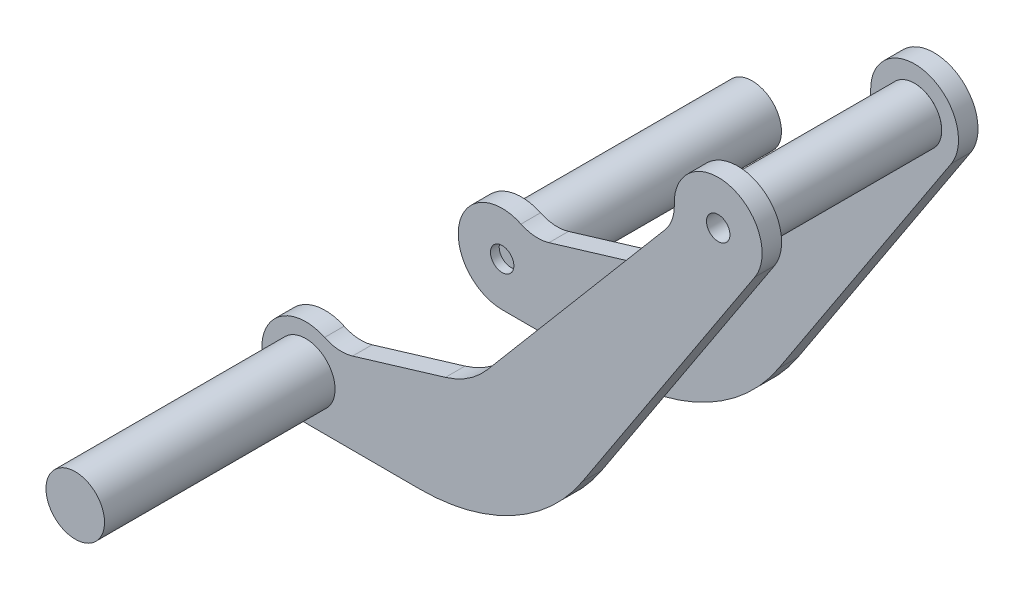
ISO-10303-21;
HEADER;
FILE_DESCRIPTION(('STEP AP214'),'2;1');
FILE_NAME('part.step','',(''),(''),'','','');
FILE_SCHEMA(('AUTOMOTIVE_DESIGN { 1 0 10303 214 1 1 1 1 }'));
ENDSEC;
DATA;
#1=APPLICATION_CONTEXT('core data for automotive mechanical design processes');
#2=APPLICATION_PROTOCOL_DEFINITION('international standard','automotive_design',2000,#1);
#3=PRODUCT_CONTEXT('',#1,'mechanical');
#4=PRODUCT('Part','Part','',(#3));
#5=PRODUCT_RELATED_PRODUCT_CATEGORY('part','',(#4));
#6=PRODUCT_DEFINITION_FORMATION('','',#4);
#7=PRODUCT_DEFINITION_CONTEXT('part definition',#1,'design');
#8=PRODUCT_DEFINITION('design','',#6,#7);
#9=PRODUCT_DEFINITION_SHAPE('','',#8);
#10=(LENGTH_UNIT() NAMED_UNIT(*) SI_UNIT(.MILLI.,.METRE.));
#11=(NAMED_UNIT(*) PLANE_ANGLE_UNIT() SI_UNIT($,.RADIAN.));
#12=(NAMED_UNIT(*) SI_UNIT($,.STERADIAN.) SOLID_ANGLE_UNIT());
#13=UNCERTAINTY_MEASURE_WITH_UNIT(LENGTH_MEASURE(1.E-05),#10,'distance_accuracy_value','');
#14=(GEOMETRIC_REPRESENTATION_CONTEXT(3) GLOBAL_UNCERTAINTY_ASSIGNED_CONTEXT((#13)) GLOBAL_UNIT_ASSIGNED_CONTEXT((#10,
#11,#12)) REPRESENTATION_CONTEXT('',''));
#15=CARTESIAN_POINT('',(0.,0.,0.));
#16=DIRECTION('',(0.,0.,1.));
#17=DIRECTION('',(1.,0.,0.));
#18=AXIS2_PLACEMENT_3D('',#15,#16,#17);
#19=CARTESIAN_POINT('',(-172.446886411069,-288.098469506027,173.4));
#20=DIRECTION('',(0.,0.,0.999999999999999));
#21=DIRECTION('',(0.93775428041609,-0.347299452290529,0.));
#22=AXIS2_PLACEMENT_3D('',#19,#20,#21);
#23=CYLINDRICAL_SURFACE('',#22,15.);
#24=CARTESIAN_POINT('',(-172.446886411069,-288.098469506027,49.8));
#25=DIRECTION('',(0.,0.,0.999999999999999));
#26=DIRECTION('',(0.93775428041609,-0.347299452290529,0.));
#27=AXIS2_PLACEMENT_3D('',#24,#25,#26);
#28=CIRCLE('',#27,15.);
#29=CARTESIAN_POINT('',(-158.380572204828,-293.307961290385,49.8));
#30=VERTEX_POINT('',#29);
#31=EDGE_CURVE('P0_E10',#30,#30,#28,.F.);
#32=CARTESIAN_POINT('',(-172.446886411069,-288.098469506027,173.4));
#33=DIRECTION('',(0.,0.,0.999999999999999));
#34=DIRECTION('',(0.93775428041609,-0.347299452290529,0.));
#35=AXIS2_PLACEMENT_3D('',#32,#33,#34);
#36=CIRCLE('',#35,15.);
#37=CARTESIAN_POINT('',(-158.380572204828,-293.307961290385,173.4));
#38=VERTEX_POINT('',#37);
#39=EDGE_CURVE('P0_E21',#38,#38,#36,.T.);
#40=CARTESIAN_POINT('',(-158.380572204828,-293.307961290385,49.8));
#41=CARTESIAN_POINT('',(-158.380572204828,-293.307961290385,51.0875));
#42=CARTESIAN_POINT('',(-158.380572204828,-293.307961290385,52.375));
#43=CARTESIAN_POINT('',(-158.380572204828,-293.307961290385,54.95));
#44=CARTESIAN_POINT('',(-158.380572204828,-293.307961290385,56.2375));
#45=CARTESIAN_POINT('',(-158.380572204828,-293.307961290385,58.8125));
#46=CARTESIAN_POINT('',(-158.380572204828,-293.307961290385,60.1));
#47=CARTESIAN_POINT('',(-158.380572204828,-293.307961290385,62.675));
#48=CARTESIAN_POINT('',(-158.380572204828,-293.307961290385,63.9625));
#49=CARTESIAN_POINT('',(-158.380572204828,-293.307961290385,66.5375));
#50=CARTESIAN_POINT('',(-158.380572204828,-293.307961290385,67.825));
#51=CARTESIAN_POINT('',(-158.380572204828,-293.307961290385,70.3999999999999));
#52=CARTESIAN_POINT('',(-158.380572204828,-293.307961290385,71.6874999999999));
#53=CARTESIAN_POINT('',(-158.380572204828,-293.307961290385,74.2624999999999));
#54=CARTESIAN_POINT('',(-158.380572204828,-293.307961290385,75.5499999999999));
#55=CARTESIAN_POINT('',(-158.380572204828,-293.307961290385,78.1249999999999));
#56=CARTESIAN_POINT('',(-158.380572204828,-293.307961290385,79.4124999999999));
#57=CARTESIAN_POINT('',(-158.380572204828,-293.307961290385,81.9874999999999));
#58=CARTESIAN_POINT('',(-158.380572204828,-293.307961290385,83.2749999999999));
#59=CARTESIAN_POINT('',(-158.380572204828,-293.307961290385,85.8499999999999));
#60=CARTESIAN_POINT('',(-158.380572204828,-293.307961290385,87.1374999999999));
#61=CARTESIAN_POINT('',(-158.380572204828,-293.307961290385,89.7124999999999));
#62=CARTESIAN_POINT('',(-158.380572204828,-293.307961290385,90.9999999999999));
#63=CARTESIAN_POINT('',(-158.380572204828,-293.307961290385,93.5749999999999));
#64=CARTESIAN_POINT('',(-158.380572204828,-293.307961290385,94.8624999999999));
#65=CARTESIAN_POINT('',(-158.380572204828,-293.307961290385,97.4374999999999));
#66=CARTESIAN_POINT('',(-158.380572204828,-293.307961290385,98.7249999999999));
#67=CARTESIAN_POINT('',(-158.380572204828,-293.307961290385,101.3));
#68=CARTESIAN_POINT('',(-158.380572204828,-293.307961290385,102.5875));
#69=CARTESIAN_POINT('',(-158.380572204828,-293.307961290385,105.1625));
#70=CARTESIAN_POINT('',(-158.380572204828,-293.307961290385,106.45));
#71=CARTESIAN_POINT('',(-158.380572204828,-293.307961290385,109.025));
#72=CARTESIAN_POINT('',(-158.380572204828,-293.307961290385,110.3125));
#73=CARTESIAN_POINT('',(-158.380572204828,-293.307961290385,112.8875));
#74=CARTESIAN_POINT('',(-158.380572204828,-293.307961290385,114.175));
#75=CARTESIAN_POINT('',(-158.380572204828,-293.307961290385,116.75));
#76=CARTESIAN_POINT('',(-158.380572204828,-293.307961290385,118.0375));
#77=CARTESIAN_POINT('',(-158.380572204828,-293.307961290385,120.6125));
#78=CARTESIAN_POINT('',(-158.380572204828,-293.307961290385,121.9));
#79=CARTESIAN_POINT('',(-158.380572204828,-293.307961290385,124.475));
#80=CARTESIAN_POINT('',(-158.380572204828,-293.307961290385,125.7625));
#81=CARTESIAN_POINT('',(-158.380572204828,-293.307961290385,128.3375));
#82=CARTESIAN_POINT('',(-158.380572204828,-293.307961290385,129.625));
#83=CARTESIAN_POINT('',(-158.380572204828,-293.307961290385,132.2));
#84=CARTESIAN_POINT('',(-158.380572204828,-293.307961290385,133.4875));
#85=CARTESIAN_POINT('',(-158.380572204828,-293.307961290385,136.0625));
#86=CARTESIAN_POINT('',(-158.380572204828,-293.307961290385,137.35));
#87=CARTESIAN_POINT('',(-158.380572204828,-293.307961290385,139.925));
#88=CARTESIAN_POINT('',(-158.380572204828,-293.307961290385,141.2125));
#89=CARTESIAN_POINT('',(-158.380572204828,-293.307961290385,143.7875));
#90=CARTESIAN_POINT('',(-158.380572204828,-293.307961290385,145.075));
#91=CARTESIAN_POINT('',(-158.380572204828,-293.307961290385,147.65));
#92=CARTESIAN_POINT('',(-158.380572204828,-293.307961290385,148.9375));
#93=CARTESIAN_POINT('',(-158.380572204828,-293.307961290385,151.5125));
#94=CARTESIAN_POINT('',(-158.380572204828,-293.307961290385,152.8));
#95=CARTESIAN_POINT('',(-158.380572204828,-293.307961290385,155.375));
#96=CARTESIAN_POINT('',(-158.380572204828,-293.307961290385,156.6625));
#97=CARTESIAN_POINT('',(-158.380572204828,-293.307961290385,159.2375));
#98=CARTESIAN_POINT('',(-158.380572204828,-293.307961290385,160.525));
#99=CARTESIAN_POINT('',(-158.380572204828,-293.307961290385,163.1));
#100=CARTESIAN_POINT('',(-158.380572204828,-293.307961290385,164.3875));
#101=CARTESIAN_POINT('',(-158.380572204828,-293.307961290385,166.9625));
#102=CARTESIAN_POINT('',(-158.380572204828,-293.307961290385,168.25));
#103=CARTESIAN_POINT('',(-158.380572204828,-293.307961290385,170.825));
#104=CARTESIAN_POINT('',(-158.380572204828,-293.307961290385,172.1125));
#105=CARTESIAN_POINT('',(-158.380572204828,-293.307961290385,173.4));
#106=B_SPLINE_CURVE_WITH_KNOTS('',3,(#40,#41,#42,#43,#44,#45,#46,#47,#48,#49,#50,#51,#52,#53,
#54,#55,#56,#57,#58,#59,#60,#61,#62,#63,#64,#65,#66,#67,#68,#69,#70,#71,#72,#73,#74,#75,#76,#77,
#78,#79,#80,#81,#82,#83,#84,#85,#86,#87,#88,#89,#90,#91,#92,#93,#94,#95,#96,#97,#98,#99,#100,
#101,#102,#103,#104,#105),.UNSPECIFIED.,.F.,.F.,(4,2,2,2,2,2,2,2,2,2,2,2,2,2,2,2,2,2,2,2,2,2,2,
2,2,2,2,2,2,2,2,2,4),(0.,3.86249999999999,7.72499999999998,11.5875,15.45,19.3125,23.175,27.0375,
30.9,34.7624999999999,38.6249999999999,42.4874999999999,46.3499999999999,50.2124999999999,
54.0749999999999,57.9374999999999,61.7999999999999,65.6624999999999,69.5249999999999,
73.3874999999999,77.2499999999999,81.1124999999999,84.9749999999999,88.8374999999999,
92.6999999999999,96.5624999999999,100.425,104.2875,108.15,112.0125,115.875,119.7375,123.6),.UNSPECIFIED.);
#107=EDGE_CURVE('P0_BSEAM14',#30,#38,#106,.T.);
#108=ORIENTED_EDGE('',*,*,#31,.F.);
#109=ORIENTED_EDGE('',*,*,#39,.F.);
#110=ORIENTED_EDGE('',*,*,#107,.T.);
#111=ORIENTED_EDGE('',*,*,#107,.F.);
#112=EDGE_LOOP('',(#108,#110,#109,#111));
#113=FACE_BOUND('',#112,.T.);
#114=ADVANCED_FACE('P0_F14',(#113),#23,.T.);
#115=CARTESIAN_POINT('',(-170.363089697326,-282.471943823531,49.8));
#116=DIRECTION('',(0.,0.,0.999999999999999));
#117=DIRECTION('',(0.93775428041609,-0.347299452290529,0.));
#118=AXIS2_PLACEMENT_3D('',#115,#116,#117);
#119=PLANE('',#118);
#120=ORIENTED_EDGE('',*,*,#31,.T.);
#121=EDGE_LOOP('',(#120));
#122=FACE_BOUND('',#121,.T.);
#123=ADVANCED_FACE('P0_F29',(#122),#119,.F.);
#124=CARTESIAN_POINT('',(-172.446886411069,-288.098469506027,173.4));
#125=DIRECTION('',(0.,0.,-0.999999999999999));
#126=DIRECTION('',(-0.93775428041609,0.347299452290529,0.));
#127=AXIS2_PLACEMENT_3D('',#124,#125,#126);
#128=PLANE('',#127);
#129=ORIENTED_EDGE('',*,*,#39,.T.);
#130=EDGE_LOOP('',(#129));
#131=FACE_BOUND('',#130,.T.);
#132=ADVANCED_FACE('P0_F16',(#131),#128,.F.);
#133=CLOSED_SHELL('',(#114,#123,#132));
#134=MANIFOLD_SOLID_BREP('P0_B1',#133);
#135=CARTESIAN_POINT('',(38.8448601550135,-118.402276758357,55.3000000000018));
#136=DIRECTION('',(0.,0.,-0.999999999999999));
#137=DIRECTION('',(-0.779674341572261,-0.626185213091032,0.));
#138=AXIS2_PLACEMENT_3D('',#135,#136,#137);
#139=CYLINDRICAL_SURFACE('',#138,22.5);
#140=CARTESIAN_POINT('',(38.8448601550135,-118.402276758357,45.3000000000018));
#141=DIRECTION('',(0.,0.,0.999999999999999));
#142=DIRECTION('',(-0.779674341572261,-0.626185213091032,0.));
#143=AXIS2_PLACEMENT_3D('',#140,#141,#142);
#144=CIRCLE('',#143,22.5);
#145=CARTESIAN_POINT('',(57.6654385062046,-130.73255779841,45.3000000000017));
#146=VERTEX_POINT('',#145);
#147=CARTESIAN_POINT('',(16.3577233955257,-119.16298718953,45.3000000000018));
#148=VERTEX_POINT('',#147);
#149=EDGE_CURVE('P1_E112',#146,#148,#144,.T.);
#150=ORIENTED_EDGE('',*,*,#149,.T.);
#151=DIRECTION('',(0.,0.,-0.999999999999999));
#152=VECTOR('',#151,1.);
#153=CARTESIAN_POINT('',(16.3577233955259,-119.16298718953,55.3000000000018));
#154=LINE('',#153,#152);
#155=CARTESIAN_POINT('',(16.3577233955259,-119.16298718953,55.3000000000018));
#156=VERTEX_POINT('',#155);
#157=EDGE_CURVE('P1_E175',#156,#148,#154,.T.);
#158=ORIENTED_EDGE('',*,*,#157,.F.);
#159=CARTESIAN_POINT('',(38.8448601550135,-118.402276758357,55.3000000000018));
#160=DIRECTION('',(0.,0.,0.999999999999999));
#161=DIRECTION('',(-0.779674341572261,-0.626185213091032,0.));
#162=AXIS2_PLACEMENT_3D('',#159,#160,#161);
#163=CIRCLE('',#162,22.5);
#164=CARTESIAN_POINT('',(57.6654385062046,-130.73255779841,55.3000000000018));
#165=VERTEX_POINT('',#164);
#166=EDGE_CURVE('P1_E151',#165,#156,#163,.T.);
#167=ORIENTED_EDGE('',*,*,#166,.F.);
#168=DIRECTION('',(0.,0.,0.999999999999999));
#169=VECTOR('',#168,1.);
#170=CARTESIAN_POINT('',(57.6654385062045,-130.73255779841,-252.829378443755));
#171=LINE('',#170,#169);
#172=EDGE_CURVE('P1_E125',#146,#165,#171,.T.);
#173=ORIENTED_EDGE('',*,*,#172,.F.);
#174=EDGE_LOOP('',(#150,#158,#167,#173));
#175=FACE_BOUND('',#174,.T.);
#176=ADVANCED_FACE('P1_F16',(#175),#139,.T.);
#177=CARTESIAN_POINT('',(-172.446886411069,-288.098469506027,55.3000000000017));
#178=DIRECTION('',(0.,0.,-0.999999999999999));
#179=DIRECTION('',(-0.779674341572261,-0.626185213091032,0.));
#180=AXIS2_PLACEMENT_3D('',#177,#178,#179);
#181=CYLINDRICAL_SURFACE('',#180,22.5);
#182=DIRECTION('',(0.,0.,0.999999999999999));
#183=VECTOR('',#182,1.);
#184=CARTESIAN_POINT('',(-172.48302865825,-310.598440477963,-252.829378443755));
#185=LINE('',#184,#183);
#186=CARTESIAN_POINT('',(-172.48302865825,-310.598440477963,45.3000000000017));
#187=VERTEX_POINT('',#186);
#188=CARTESIAN_POINT('',(-172.48302865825,-310.598440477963,55.3000000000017));
#189=VERTEX_POINT('',#188);
#190=EDGE_CURVE('P1_E121',#187,#189,#185,.T.);
#191=ORIENTED_EDGE('',*,*,#190,.T.);
#192=CARTESIAN_POINT('',(-172.446886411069,-288.098469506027,55.3000000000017));
#193=DIRECTION('',(0.,0.,0.999999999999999));
#194=DIRECTION('',(-0.779674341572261,-0.626185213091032,0.));
#195=AXIS2_PLACEMENT_3D('',#192,#193,#194);
#196=CIRCLE('',#195,22.5);
#197=CARTESIAN_POINT('',(-162.796186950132,-267.77326348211,55.3000000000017));
#198=VERTEX_POINT('',#197);
#199=EDGE_CURVE('P1_E160',#198,#189,#196,.T.);
#200=ORIENTED_EDGE('',*,*,#199,.F.);
#201=DIRECTION('',(0.,0.,-0.999999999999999));
#202=VECTOR('',#201,1.);
#203=CARTESIAN_POINT('',(-162.796186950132,-267.77326348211,55.3000000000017));
#204=LINE('',#203,#202);
#205=CARTESIAN_POINT('',(-162.796186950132,-267.77326348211,45.3000000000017));
#206=VERTEX_POINT('',#205);
#207=EDGE_CURVE('P1_E172',#206,#198,#204,.F.);
#208=ORIENTED_EDGE('',*,*,#207,.F.);
#209=CARTESIAN_POINT('',(-172.446886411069,-288.098469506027,45.3000000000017));
#210=DIRECTION('',(0.,0.,0.999999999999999));
#211=DIRECTION('',(-0.779674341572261,-0.626185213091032,0.));
#212=AXIS2_PLACEMENT_3D('',#209,#210,#211);
#213=CIRCLE('',#212,22.5);
#214=EDGE_CURVE('P1_E142',#206,#187,#213,.T.);
#215=ORIENTED_EDGE('',*,*,#214,.T.);
#216=EDGE_LOOP('',(#191,#200,#208,#215));
#217=FACE_BOUND('',#216,.T.);
#218=ADVANCED_FACE('P1_F204',(#217),#181,.T.);
#219=CARTESIAN_POINT('',(-157.248162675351,-271.507845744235,55.3000000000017));
#220=DIRECTION('',(-0.288517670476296,0.957474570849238,0.));
#221=DIRECTION('',(-0.957474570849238,-0.288517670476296,0.));
#222=AXIS2_PLACEMENT_3D('',#219,#220,#221);
#223=PLANE('',#222);
#224=DIRECTION('',(-0.957474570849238,-0.288517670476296,0.));
#225=VECTOR('',#224,1.);
#226=CARTESIAN_POINT('',(-157.248162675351,-271.507845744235,55.3000000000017));
#227=LINE('',#226,#225);
#228=CARTESIAN_POINT('',(-100.884434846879,-254.523654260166,55.3000000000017));
#229=VERTEX_POINT('',#228);
#230=CARTESIAN_POINT('',(-148.447434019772,-268.855905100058,55.3000000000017));
#231=VERTEX_POINT('',#230);
#232=EDGE_CURVE('P1_E157',#229,#231,#227,.T.);
#233=ORIENTED_EDGE('',*,*,#232,.F.);
#234=DIRECTION('',(0.,0.,-0.999999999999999));
#235=VECTOR('',#234,1.);
#236=CARTESIAN_POINT('',(-100.884434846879,-254.523654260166,55.3000000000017));
#237=LINE('',#236,#235);
#238=CARTESIAN_POINT('',(-100.88443484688,-254.523654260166,45.3000000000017));
#239=VERTEX_POINT('',#238);
#240=EDGE_CURVE('P1_E166',#229,#239,#237,.T.);
#241=ORIENTED_EDGE('',*,*,#240,.T.);
#242=DIRECTION('',(-0.957474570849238,-0.288517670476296,0.));
#243=VECTOR('',#242,1.);
#244=CARTESIAN_POINT('',(-100.88443484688,-254.523654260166,45.3000000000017));
#245=LINE('',#244,#243);
#246=CARTESIAN_POINT('',(-148.447434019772,-268.855905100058,45.3000000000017));
#247=VERTEX_POINT('',#246);
#248=EDGE_CURVE('P1_E139',#239,#247,#245,.T.);
#249=ORIENTED_EDGE('',*,*,#248,.T.);
#250=DIRECTION('',(0.,0.,0.999999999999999));
#251=VECTOR('',#250,1.);
#252=CARTESIAN_POINT('',(-148.447434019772,-268.855905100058,45.3000000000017));
#253=LINE('',#252,#251);
#254=EDGE_CURVE('P1_E169',#231,#247,#253,.F.);
#255=ORIENTED_EDGE('',*,*,#254,.F.);
#256=EDGE_LOOP('',(#233,#241,#249,#255));
#257=FACE_BOUND('',#256,.T.);
#258=ADVANCED_FACE('P1_F189',(#257),#223,.T.);
#259=CARTESIAN_POINT('',(-113.867730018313,-211.437298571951,55.3000000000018));
#260=DIRECTION('',(0.,0.,-0.999999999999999));
#261=DIRECTION('',(-0.779674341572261,-0.626185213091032,0.));
#262=AXIS2_PLACEMENT_3D('',#259,#260,#261);
#263=CYLINDRICAL_SURFACE('',#262,45.);
#264=DIRECTION('',(0.,0.,-0.999999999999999));
#265=VECTOR('',#264,1.);
#266=CARTESIAN_POINT('',(-79.5125112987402,-240.501347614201,55.3000000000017));
#267=LINE('',#266,#265);
#268=CARTESIAN_POINT('',(-79.5125112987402,-240.501347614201,55.3000000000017));
#269=VERTEX_POINT('',#268);
#270=CARTESIAN_POINT('',(-79.5125112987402,-240.501347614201,45.3000000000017));
#271=VERTEX_POINT('',#270);
#272=EDGE_CURVE('P1_E163',#269,#271,#267,.T.);
#273=ORIENTED_EDGE('',*,*,#272,.T.);
#274=CARTESIAN_POINT('',(-113.867730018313,-211.437298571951,45.3000000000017));
#275=DIRECTION('',(0.,0.,-0.999999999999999));
#276=DIRECTION('',(-0.779674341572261,-0.626185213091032,0.));
#277=AXIS2_PLACEMENT_3D('',#274,#275,#276);
#278=CIRCLE('',#277,45.);
#279=EDGE_CURVE('P1_E137',#271,#239,#278,.T.);
#280=ORIENTED_EDGE('',*,*,#279,.T.);
#281=ORIENTED_EDGE('',*,*,#240,.F.);
#282=CARTESIAN_POINT('',(-113.867730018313,-211.437298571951,55.3000000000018));
#283=DIRECTION('',(0.,0.,-0.999999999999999));
#284=DIRECTION('',(-0.779674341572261,-0.626185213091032,0.));
#285=AXIS2_PLACEMENT_3D('',#282,#283,#284);
#286=CIRCLE('',#285,45.);
#287=EDGE_CURVE('P1_E155',#269,#229,#286,.T.);
#288=ORIENTED_EDGE('',*,*,#287,.F.);
#289=EDGE_LOOP('',(#273,#280,#281,#288));
#290=FACE_BOUND('',#289,.T.);
#291=ADVANCED_FACE('P1_F198',(#290),#263,.F.);
#292=CARTESIAN_POINT('',(17.5747051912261,-125.739204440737,55.3000000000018));
#293=DIRECTION('',(-0.763449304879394,0.645867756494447,0.));
#294=DIRECTION('',(-0.645867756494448,-0.763449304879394,0.));
#295=AXIS2_PLACEMENT_3D('',#292,#293,#294);
#296=PLANE('',#295);
#297=DIRECTION('',(-0.645867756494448,-0.763449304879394,0.));
#298=VECTOR('',#297,1.);
#299=CARTESIAN_POINT('',(17.5747051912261,-125.739204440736,45.3000000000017));
#300=LINE('',#299,#298);
#301=CARTESIAN_POINT('',(11.6381434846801,-132.75652936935,45.3000000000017));
#302=VERTEX_POINT('',#301);
#303=EDGE_CURVE('P1_E135',#302,#271,#300,.T.);
#304=ORIENTED_EDGE('',*,*,#303,.T.);
#305=ORIENTED_EDGE('',*,*,#272,.F.);
#306=DIRECTION('',(-0.645867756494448,-0.763449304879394,0.));
#307=VECTOR('',#306,1.);
#308=CARTESIAN_POINT('',(17.5747051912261,-125.739204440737,55.3000000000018));
#309=LINE('',#308,#307);
#310=CARTESIAN_POINT('',(11.63814348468,-132.75652936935,55.3000000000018));
#311=VERTEX_POINT('',#310);
#312=EDGE_CURVE('P1_E153',#311,#269,#309,.T.);
#313=ORIENTED_EDGE('',*,*,#312,.F.);
#314=DIRECTION('',(0.,0.,0.999999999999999));
#315=VECTOR('',#314,1.);
#316=CARTESIAN_POINT('',(11.63814348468,-132.75652936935,55.3000000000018));
#317=LINE('',#316,#315);
#318=EDGE_CURVE('P1_E177',#302,#311,#317,.T.);
#319=ORIENTED_EDGE('',*,*,#318,.F.);
#320=EDGE_LOOP('',(#304,#305,#313,#319));
#321=FACE_BOUND('',#320,.T.);
#322=ADVANCED_FACE('P1_F224',(#321),#296,.T.);
#323=CARTESIAN_POINT('',(-172.446886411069,-288.098469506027,55.3000000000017));
#324=DIRECTION('',(0.,0.,-0.999999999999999));
#325=DIRECTION('',(-0.779674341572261,-0.626185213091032,0.));
#326=AXIS2_PLACEMENT_3D('',#323,#324,#325);
#327=PLANE('',#326);
#328=ORIENTED_EDGE('',*,*,#166,.T.);
#329=CARTESIAN_POINT('',(-3.63084261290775,-119.839174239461,55.3000000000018));
#330=DIRECTION('',(0.,0.,0.999999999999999));
#331=DIRECTION('',(-0.779674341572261,-0.626185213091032,0.));
#332=AXIS2_PLACEMENT_3D('',#329,#330,#331);
#333=CIRCLE('',#332,20.);
#334=EDGE_CURVE('P1_E11',#311,#156,#333,.T.);
#335=ORIENTED_EDGE('',*,*,#334,.F.);
#336=ORIENTED_EDGE('',*,*,#312,.T.);
#337=ORIENTED_EDGE('',*,*,#287,.T.);
#338=ORIENTED_EDGE('',*,*,#232,.T.);
#339=CARTESIAN_POINT('',(-154.217787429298,-249.706413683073,55.3000000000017));
#340=DIRECTION('',(0.,0.,0.999999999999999));
#341=DIRECTION('',(-0.779674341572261,-0.626185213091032,0.));
#342=AXIS2_PLACEMENT_3D('',#339,#340,#341);
#343=CIRCLE('',#342,20.);
#344=EDGE_CURVE('P1_E181',#198,#231,#343,.T.);
#345=ORIENTED_EDGE('',*,*,#344,.F.);
#346=ORIENTED_EDGE('',*,*,#199,.T.);
#347=DIRECTION('',(-0.999998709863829,0.00160632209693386,0.));
#348=VECTOR('',#347,1.);
#349=CARTESIAN_POINT('',(-114.027165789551,-310.692339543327,55.3000000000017));
#350=LINE('',#349,#348);
#351=CARTESIAN_POINT('',(-114.027165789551,-310.692339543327,55.3000000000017));
#352=VERTEX_POINT('',#351);
#353=EDGE_CURVE('P1_E113',#352,#189,#350,.T.);
#354=ORIENTED_EDGE('',*,*,#353,.F.);
#355=CARTESIAN_POINT('',(-113.867730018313,-211.437298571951,55.3000000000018));
#356=DIRECTION('',(0.,0.,-0.999999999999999));
#357=DIRECTION('',(0.779674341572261,0.626185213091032,0.));
#358=AXIS2_PLACEMENT_3D('',#355,#356,#357);
#359=CIRCLE('',#358,99.2551690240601);
#360=CARTESIAN_POINT('',(-30.8437440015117,-265.830370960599,55.3000000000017));
#361=VERTEX_POINT('',#360);
#362=EDGE_CURVE('P1_E115',#361,#352,#359,.T.);
#363=ORIENTED_EDGE('',*,*,#362,.F.);
#364=DIRECTION('',(-0.54801249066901,-0.836470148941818,0.));
#365=VECTOR('',#364,1.);
#366=CARTESIAN_POINT('',(57.6654385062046,-130.73255779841,55.3000000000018));
#367=LINE('',#366,#365);
#368=EDGE_CURVE('P1_E96',#165,#361,#367,.T.);
#369=ORIENTED_EDGE('',*,*,#368,.F.);
#370=EDGE_LOOP('',(#328,#335,#336,#337,#338,#345,#346,#354,#363,#369));
#371=FACE_BOUND('',#370,.T.);
#372=CARTESIAN_POINT('',(38.8448601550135,-118.402276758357,55.3000000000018));
#373=DIRECTION('',(0.,0.,-0.999999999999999));
#374=DIRECTION('',(0.779674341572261,0.626185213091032,0.));
#375=AXIS2_PLACEMENT_3D('',#372,#373,#374);
#376=CIRCLE('',#375,6.00000000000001);
#377=CARTESIAN_POINT('',(43.5229062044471,-114.645165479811,55.3000000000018));
#378=VERTEX_POINT('',#377);
#379=EDGE_CURVE('P1_E145',#378,#378,#376,.T.);
#380=ORIENTED_EDGE('',*,*,#379,.T.);
#381=EDGE_LOOP('',(#380));
#382=FACE_BOUND('',#381,.T.);
#383=CARTESIAN_POINT('',(-172.446886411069,-288.098469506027,55.3000000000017));
#384=DIRECTION('',(0.,0.,0.999999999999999));
#385=DIRECTION('',(-0.779674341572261,-0.626185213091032,0.));
#386=AXIS2_PLACEMENT_3D('',#383,#384,#385);
#387=CIRCLE('',#386,6.);
#388=CARTESIAN_POINT('',(-177.124932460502,-291.855580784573,55.3000000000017));
#389=VERTEX_POINT('',#388);
#390=EDGE_CURVE('P1_E148',#389,#389,#387,.T.);
#391=ORIENTED_EDGE('',*,*,#390,.F.);
#392=EDGE_LOOP('',(#391));
#393=FACE_BOUND('',#392,.T.);
#394=ADVANCED_FACE('P1_F191',(#371,#382,#393),#327,.F.);
#395=CARTESIAN_POINT('',(-172.446886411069,-288.098469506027,49.3000000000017));
#396=DIRECTION('',(0.,0.,-0.999999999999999));
#397=DIRECTION('',(-0.779674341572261,-0.626185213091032,0.));
#398=AXIS2_PLACEMENT_3D('',#395,#396,#397);
#399=CYLINDRICAL_SURFACE('',#398,6.);
#400=CARTESIAN_POINT('',(-172.446886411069,-288.098469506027,45.3000000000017));
#401=DIRECTION('',(0.,0.,0.999999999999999));
#402=DIRECTION('',(-0.779674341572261,-0.626185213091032,0.));
#403=AXIS2_PLACEMENT_3D('',#400,#401,#402);
#404=CIRCLE('',#403,6.);
#405=CARTESIAN_POINT('',(-177.124932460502,-291.855580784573,45.3000000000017));
#406=VERTEX_POINT('',#405);
#407=EDGE_CURVE('P1_E131',#406,#406,#404,.T.);
#408=CARTESIAN_POINT('',(-177.124932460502,-291.855580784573,55.3000000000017));
#409=CARTESIAN_POINT('',(-177.124932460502,-291.855580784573,55.1958333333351));
#410=CARTESIAN_POINT('',(-177.124932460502,-291.855580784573,55.0916666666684));
#411=CARTESIAN_POINT('',(-177.124932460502,-291.855580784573,54.8833333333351));
#412=CARTESIAN_POINT('',(-177.124932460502,-291.855580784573,54.7791666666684));
#413=CARTESIAN_POINT('',(-177.124932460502,-291.855580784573,54.5708333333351));
#414=CARTESIAN_POINT('',(-177.124932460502,-291.855580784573,54.4666666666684));
#415=CARTESIAN_POINT('',(-177.124932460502,-291.855580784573,54.2583333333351));
#416=CARTESIAN_POINT('',(-177.124932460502,-291.855580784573,54.1541666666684));
#417=CARTESIAN_POINT('',(-177.124932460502,-291.855580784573,53.9458333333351));
#418=CARTESIAN_POINT('',(-177.124932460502,-291.855580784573,53.8416666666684));
#419=CARTESIAN_POINT('',(-177.124932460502,-291.855580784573,53.6333333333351));
#420=CARTESIAN_POINT('',(-177.124932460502,-291.855580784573,53.5291666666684));
#421=CARTESIAN_POINT('',(-177.124932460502,-291.855580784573,53.3208333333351));
#422=CARTESIAN_POINT('',(-177.124932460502,-291.855580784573,53.2166666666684));
#423=CARTESIAN_POINT('',(-177.124932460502,-291.855580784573,53.0083333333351));
#424=CARTESIAN_POINT('',(-177.124932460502,-291.855580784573,52.9041666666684));
#425=CARTESIAN_POINT('',(-177.124932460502,-291.855580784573,52.6958333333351));
#426=CARTESIAN_POINT('',(-177.124932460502,-291.855580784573,52.5916666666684));
#427=CARTESIAN_POINT('',(-177.124932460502,-291.855580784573,52.3833333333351));
#428=CARTESIAN_POINT('',(-177.124932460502,-291.855580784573,52.2791666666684));
#429=CARTESIAN_POINT('',(-177.124932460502,-291.855580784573,52.0708333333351));
#430=CARTESIAN_POINT('',(-177.124932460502,-291.855580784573,51.9666666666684));
#431=CARTESIAN_POINT('',(-177.124932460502,-291.855580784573,51.7583333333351));
#432=CARTESIAN_POINT('',(-177.124932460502,-291.855580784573,51.6541666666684));
#433=CARTESIAN_POINT('',(-177.124932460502,-291.855580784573,51.4458333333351));
#434=CARTESIAN_POINT('',(-177.124932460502,-291.855580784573,51.3416666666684));
#435=CARTESIAN_POINT('',(-177.124932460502,-291.855580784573,51.1333333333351));
#436=CARTESIAN_POINT('',(-177.124932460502,-291.855580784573,51.0291666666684));
#437=CARTESIAN_POINT('',(-177.124932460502,-291.855580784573,50.8208333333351));
#438=CARTESIAN_POINT('',(-177.124932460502,-291.855580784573,50.7166666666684));
#439=CARTESIAN_POINT('',(-177.124932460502,-291.855580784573,50.5083333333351));
#440=CARTESIAN_POINT('',(-177.124932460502,-291.855580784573,50.4041666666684));
#441=CARTESIAN_POINT('',(-177.124932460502,-291.855580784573,50.1958333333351));
#442=CARTESIAN_POINT('',(-177.124932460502,-291.855580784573,50.0916666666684));
#443=CARTESIAN_POINT('',(-177.124932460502,-291.855580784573,49.8833333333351));
#444=CARTESIAN_POINT('',(-177.124932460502,-291.855580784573,49.7791666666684));
#445=CARTESIAN_POINT('',(-177.124932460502,-291.855580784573,49.5708333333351));
#446=CARTESIAN_POINT('',(-177.124932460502,-291.855580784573,49.4666666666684));
#447=CARTESIAN_POINT('',(-177.124932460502,-291.855580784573,49.2583333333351));
#448=CARTESIAN_POINT('',(-177.124932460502,-291.855580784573,49.1541666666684));
#449=CARTESIAN_POINT('',(-177.124932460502,-291.855580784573,48.9458333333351));
#450=CARTESIAN_POINT('',(-177.124932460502,-291.855580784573,48.8416666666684));
#451=CARTESIAN_POINT('',(-177.124932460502,-291.855580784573,48.6333333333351));
#452=CARTESIAN_POINT('',(-177.124932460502,-291.855580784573,48.5291666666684));
#453=CARTESIAN_POINT('',(-177.124932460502,-291.855580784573,48.3208333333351));
#454=CARTESIAN_POINT('',(-177.124932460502,-291.855580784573,48.2166666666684));
#455=CARTESIAN_POINT('',(-177.124932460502,-291.855580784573,48.0083333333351));
#456=CARTESIAN_POINT('',(-177.124932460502,-291.855580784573,47.9041666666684));
#457=CARTESIAN_POINT('',(-177.124932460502,-291.855580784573,47.6958333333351));
#458=CARTESIAN_POINT('',(-177.124932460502,-291.855580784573,47.5916666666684));
#459=CARTESIAN_POINT('',(-177.124932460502,-291.855580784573,47.3833333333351));
#460=CARTESIAN_POINT('',(-177.124932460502,-291.855580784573,47.2791666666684));
#461=CARTESIAN_POINT('',(-177.124932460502,-291.855580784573,47.0708333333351));
#462=CARTESIAN_POINT('',(-177.124932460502,-291.855580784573,46.9666666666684));
#463=CARTESIAN_POINT('',(-177.124932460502,-291.855580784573,46.7583333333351));
#464=CARTESIAN_POINT('',(-177.124932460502,-291.855580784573,46.6541666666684));
#465=CARTESIAN_POINT('',(-177.124932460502,-291.855580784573,46.4458333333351));
#466=CARTESIAN_POINT('',(-177.124932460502,-291.855580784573,46.3416666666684));
#467=CARTESIAN_POINT('',(-177.124932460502,-291.855580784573,46.1333333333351));
#468=CARTESIAN_POINT('',(-177.124932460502,-291.855580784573,46.0291666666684));
#469=CARTESIAN_POINT('',(-177.124932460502,-291.855580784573,45.8208333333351));
#470=CARTESIAN_POINT('',(-177.124932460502,-291.855580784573,45.7166666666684));
#471=CARTESIAN_POINT('',(-177.124932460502,-291.855580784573,45.5083333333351));
#472=CARTESIAN_POINT('',(-177.124932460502,-291.855580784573,45.4041666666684));
#473=CARTESIAN_POINT('',(-177.124932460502,-291.855580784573,45.3000000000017));
#474=B_SPLINE_CURVE_WITH_KNOTS('',3,(#408,#409,#410,#411,#412,#413,#414,#415,#416,#417,#418,
#419,#420,#421,#422,#423,#424,#425,#426,#427,#428,#429,#430,#431,#432,#433,#434,#435,#436,#437,
#438,#439,#440,#441,#442,#443,#444,#445,#446,#447,#448,#449,#450,#451,#452,#453,#454,#455,#456,
#457,#458,#459,#460,#461,#462,#463,#464,#465,#466,#467,#468,#469,#470,#471,#472,#473),
.UNSPECIFIED.,.F.,.F.,(4,2,2,2,2,2,2,2,2,2,2,2,2,2,2,2,2,2,2,2,2,2,2,2,2,2,2,2,2,2,2,2,4),(0.,
0.312499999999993,0.625000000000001,0.937499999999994,1.24999999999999,1.56249999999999,
1.87499999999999,2.1875,2.5,2.8125,3.125,3.4375,3.75,4.0625,4.375,4.6875,5.,5.3125,5.625,5.9375,
6.25,6.5625,6.875,7.1875,7.5,7.8125,8.125,8.4375,8.75,9.0625,9.375,9.6875,9.99999999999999),.UNSPECIFIED.);
#475=EDGE_CURVE('P1_BSEAM227',#389,#406,#474,.T.);
#476=ORIENTED_EDGE('',*,*,#390,.T.);
#477=ORIENTED_EDGE('',*,*,#407,.F.);
#478=ORIENTED_EDGE('',*,*,#475,.T.);
#479=ORIENTED_EDGE('',*,*,#475,.F.);
#480=EDGE_LOOP('',(#476,#478,#477,#479));
#481=FACE_BOUND('',#480,.T.);
#482=ADVANCED_FACE('P1_F227',(#481),#399,.F.);
#483=CARTESIAN_POINT('',(38.8448601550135,-118.402276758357,55.3000000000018));
#484=DIRECTION('',(0.,0.,0.999999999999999));
#485=DIRECTION('',(0.779674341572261,0.626185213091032,0.));
#486=AXIS2_PLACEMENT_3D('',#483,#484,#485);
#487=CYLINDRICAL_SURFACE('',#486,6.00000000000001);
#488=CARTESIAN_POINT('',(38.8448601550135,-118.402276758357,45.3000000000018));
#489=DIRECTION('',(0.,0.,0.999999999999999));
#490=DIRECTION('',(-0.779674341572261,-0.626185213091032,0.));
#491=AXIS2_PLACEMENT_3D('',#488,#489,#490);
#492=CIRCLE('',#491,5.99999999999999);
#493=CARTESIAN_POINT('',(43.5229062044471,-114.645165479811,45.3000000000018));
#494=VERTEX_POINT('',#493);
#495=EDGE_CURVE('P1_E128',#494,#494,#492,.T.);
#496=CARTESIAN_POINT('',(43.5229062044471,-114.645165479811,55.3000000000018));
#497=CARTESIAN_POINT('',(43.5229062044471,-114.645165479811,55.1958333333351));
#498=CARTESIAN_POINT('',(43.5229062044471,-114.645165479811,55.0916666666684));
#499=CARTESIAN_POINT('',(43.5229062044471,-114.645165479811,54.8833333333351));
#500=CARTESIAN_POINT('',(43.5229062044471,-114.645165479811,54.7791666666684));
#501=CARTESIAN_POINT('',(43.5229062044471,-114.645165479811,54.5708333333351));
#502=CARTESIAN_POINT('',(43.5229062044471,-114.645165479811,54.4666666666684));
#503=CARTESIAN_POINT('',(43.5229062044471,-114.645165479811,54.2583333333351));
#504=CARTESIAN_POINT('',(43.5229062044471,-114.645165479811,54.1541666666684));
#505=CARTESIAN_POINT('',(43.5229062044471,-114.645165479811,53.9458333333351));
#506=CARTESIAN_POINT('',(43.5229062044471,-114.645165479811,53.8416666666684));
#507=CARTESIAN_POINT('',(43.5229062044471,-114.645165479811,53.6333333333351));
#508=CARTESIAN_POINT('',(43.5229062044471,-114.645165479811,53.5291666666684));
#509=CARTESIAN_POINT('',(43.5229062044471,-114.645165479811,53.3208333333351));
#510=CARTESIAN_POINT('',(43.5229062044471,-114.645165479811,53.2166666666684));
#511=CARTESIAN_POINT('',(43.5229062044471,-114.645165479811,53.0083333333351));
#512=CARTESIAN_POINT('',(43.5229062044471,-114.645165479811,52.9041666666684));
#513=CARTESIAN_POINT('',(43.5229062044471,-114.645165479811,52.6958333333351));
#514=CARTESIAN_POINT('',(43.5229062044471,-114.645165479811,52.5916666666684));
#515=CARTESIAN_POINT('',(43.5229062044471,-114.645165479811,52.3833333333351));
#516=CARTESIAN_POINT('',(43.5229062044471,-114.645165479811,52.2791666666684));
#517=CARTESIAN_POINT('',(43.5229062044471,-114.645165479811,52.0708333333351));
#518=CARTESIAN_POINT('',(43.5229062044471,-114.645165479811,51.9666666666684));
#519=CARTESIAN_POINT('',(43.5229062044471,-114.645165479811,51.7583333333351));
#520=CARTESIAN_POINT('',(43.5229062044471,-114.645165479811,51.6541666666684));
#521=CARTESIAN_POINT('',(43.5229062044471,-114.645165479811,51.4458333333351));
#522=CARTESIAN_POINT('',(43.5229062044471,-114.645165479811,51.3416666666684));
#523=CARTESIAN_POINT('',(43.5229062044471,-114.645165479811,51.1333333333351));
#524=CARTESIAN_POINT('',(43.5229062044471,-114.645165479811,51.0291666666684));
#525=CARTESIAN_POINT('',(43.5229062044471,-114.645165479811,50.8208333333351));
#526=CARTESIAN_POINT('',(43.5229062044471,-114.645165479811,50.7166666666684));
#527=CARTESIAN_POINT('',(43.5229062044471,-114.645165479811,50.5083333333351));
#528=CARTESIAN_POINT('',(43.5229062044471,-114.645165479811,50.4041666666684));
#529=CARTESIAN_POINT('',(43.5229062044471,-114.645165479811,50.1958333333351));
#530=CARTESIAN_POINT('',(43.5229062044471,-114.645165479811,50.0916666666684));
#531=CARTESIAN_POINT('',(43.5229062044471,-114.645165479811,49.8833333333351));
#532=CARTESIAN_POINT('',(43.5229062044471,-114.645165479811,49.7791666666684));
#533=CARTESIAN_POINT('',(43.5229062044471,-114.645165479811,49.5708333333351));
#534=CARTESIAN_POINT('',(43.5229062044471,-114.645165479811,49.4666666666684));
#535=CARTESIAN_POINT('',(43.5229062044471,-114.645165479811,49.2583333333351));
#536=CARTESIAN_POINT('',(43.5229062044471,-114.645165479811,49.1541666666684));
#537=CARTESIAN_POINT('',(43.5229062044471,-114.645165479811,48.9458333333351));
#538=CARTESIAN_POINT('',(43.5229062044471,-114.645165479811,48.8416666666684));
#539=CARTESIAN_POINT('',(43.5229062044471,-114.645165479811,48.6333333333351));
#540=CARTESIAN_POINT('',(43.5229062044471,-114.645165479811,48.5291666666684));
#541=CARTESIAN_POINT('',(43.5229062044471,-114.645165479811,48.3208333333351));
#542=CARTESIAN_POINT('',(43.5229062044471,-114.645165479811,48.2166666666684));
#543=CARTESIAN_POINT('',(43.5229062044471,-114.645165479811,48.0083333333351));
#544=CARTESIAN_POINT('',(43.5229062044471,-114.645165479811,47.9041666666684));
#545=CARTESIAN_POINT('',(43.5229062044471,-114.645165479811,47.6958333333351));
#546=CARTESIAN_POINT('',(43.5229062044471,-114.645165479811,47.5916666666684));
#547=CARTESIAN_POINT('',(43.5229062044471,-114.645165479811,47.3833333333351));
#548=CARTESIAN_POINT('',(43.5229062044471,-114.645165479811,47.2791666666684));
#549=CARTESIAN_POINT('',(43.5229062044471,-114.645165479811,47.0708333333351));
#550=CARTESIAN_POINT('',(43.5229062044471,-114.645165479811,46.9666666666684));
#551=CARTESIAN_POINT('',(43.5229062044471,-114.645165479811,46.7583333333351));
#552=CARTESIAN_POINT('',(43.5229062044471,-114.645165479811,46.6541666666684));
#553=CARTESIAN_POINT('',(43.5229062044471,-114.645165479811,46.4458333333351));
#554=CARTESIAN_POINT('',(43.5229062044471,-114.645165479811,46.3416666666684));
#555=CARTESIAN_POINT('',(43.5229062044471,-114.645165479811,46.1333333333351));
#556=CARTESIAN_POINT('',(43.5229062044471,-114.645165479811,46.0291666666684));
#557=CARTESIAN_POINT('',(43.5229062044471,-114.645165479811,45.8208333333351));
#558=CARTESIAN_POINT('',(43.5229062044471,-114.645165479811,45.7166666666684));
#559=CARTESIAN_POINT('',(43.5229062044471,-114.645165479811,45.5083333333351));
#560=CARTESIAN_POINT('',(43.5229062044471,-114.645165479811,45.4041666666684));
#561=CARTESIAN_POINT('',(43.5229062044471,-114.645165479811,45.3000000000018));
#562=B_SPLINE_CURVE_WITH_KNOTS('',3,(#496,#497,#498,#499,#500,#501,#502,#503,#504,#505,#506,
#507,#508,#509,#510,#511,#512,#513,#514,#515,#516,#517,#518,#519,#520,#521,#522,#523,#524,#525,
#526,#527,#528,#529,#530,#531,#532,#533,#534,#535,#536,#537,#538,#539,#540,#541,#542,#543,#544,
#545,#546,#547,#548,#549,#550,#551,#552,#553,#554,#555,#556,#557,#558,#559,#560,#561),
.UNSPECIFIED.,.F.,.F.,(4,2,2,2,2,2,2,2,2,2,2,2,2,2,2,2,2,2,2,2,2,2,2,2,2,2,2,2,2,2,2,2,4),(0.,
0.312499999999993,0.624999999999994,0.937499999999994,1.24999999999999,1.56249999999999,
1.87499999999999,2.1875,2.5,2.8125,3.125,3.4375,3.75,4.0625,4.375,4.6875,5.,5.3125,5.625,5.9375,
6.25,6.5625,6.875,7.1875,7.5,7.81249999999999,8.125,8.43749999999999,8.75,9.06249999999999,
9.37499999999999,9.68749999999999,9.99999999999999),.UNSPECIFIED.);
#563=EDGE_CURVE('P1_BSEAM233',#378,#494,#562,.T.);
#564=ORIENTED_EDGE('',*,*,#379,.F.);
#565=ORIENTED_EDGE('',*,*,#495,.F.);
#566=ORIENTED_EDGE('',*,*,#563,.T.);
#567=ORIENTED_EDGE('',*,*,#563,.F.);
#568=EDGE_LOOP('',(#564,#566,#565,#567));
#569=FACE_BOUND('',#568,.T.);
#570=ADVANCED_FACE('P1_F233',(#569),#487,.F.);
#571=CARTESIAN_POINT('',(38.8448601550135,-118.402276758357,45.3000000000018));
#572=DIRECTION('',(0.,0.,-0.999999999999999));
#573=DIRECTION('',(-0.779674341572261,-0.626185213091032,0.));
#574=AXIS2_PLACEMENT_3D('',#571,#572,#573);
#575=PLANE('',#574);
#576=DIRECTION('',(-0.54801249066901,-0.836470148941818,0.));
#577=VECTOR('',#576,1.);
#578=CARTESIAN_POINT('',(57.6654385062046,-130.73255779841,45.3000000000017));
#579=LINE('',#578,#577);
#580=CARTESIAN_POINT('',(-30.8437440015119,-265.830370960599,45.3000000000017));
#581=VERTEX_POINT('',#580);
#582=EDGE_CURVE('P1_E94',#146,#581,#579,.T.);
#583=ORIENTED_EDGE('',*,*,#582,.T.);
#584=CARTESIAN_POINT('',(-113.867730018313,-211.437298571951,45.3000000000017));
#585=DIRECTION('',(0.,0.,0.999999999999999));
#586=DIRECTION('',(-0.779674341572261,-0.626185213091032,0.));
#587=AXIS2_PLACEMENT_3D('',#584,#585,#586);
#588=CIRCLE('',#587,99.2551690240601);
#589=CARTESIAN_POINT('',(-114.027165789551,-310.692339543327,45.3000000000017));
#590=VERTEX_POINT('',#589);
#591=EDGE_CURVE('P1_E100',#581,#590,#588,.F.);
#592=ORIENTED_EDGE('',*,*,#591,.T.);
#593=DIRECTION('',(-0.999998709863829,0.00160632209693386,0.));
#594=VECTOR('',#593,1.);
#595=CARTESIAN_POINT('',(-114.027165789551,-310.692339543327,45.3000000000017));
#596=LINE('',#595,#594);
#597=EDGE_CURVE('P1_E120',#590,#187,#596,.T.);
#598=ORIENTED_EDGE('',*,*,#597,.T.);
#599=ORIENTED_EDGE('',*,*,#214,.F.);
#600=CARTESIAN_POINT('',(-154.217787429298,-249.706413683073,45.3000000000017));
#601=DIRECTION('',(0.,0.,0.999999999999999));
#602=DIRECTION('',(-0.779674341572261,-0.626185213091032,0.));
#603=AXIS2_PLACEMENT_3D('',#600,#601,#602);
#604=CIRCLE('',#603,20.);
#605=EDGE_CURVE('P1_E179',#247,#206,#604,.F.);
#606=ORIENTED_EDGE('',*,*,#605,.F.);
#607=ORIENTED_EDGE('',*,*,#248,.F.);
#608=ORIENTED_EDGE('',*,*,#279,.F.);
#609=ORIENTED_EDGE('',*,*,#303,.F.);
#610=CARTESIAN_POINT('',(-3.63084261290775,-119.839174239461,45.3000000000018));
#611=DIRECTION('',(0.,0.,0.999999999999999));
#612=DIRECTION('',(-0.779674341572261,-0.626185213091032,0.));
#613=AXIS2_PLACEMENT_3D('',#610,#611,#612);
#614=CIRCLE('',#613,20.);
#615=EDGE_CURVE('P1_E24',#148,#302,#614,.F.);
#616=ORIENTED_EDGE('',*,*,#615,.F.);
#617=ORIENTED_EDGE('',*,*,#149,.F.);
#618=EDGE_LOOP('',(#583,#592,#598,#599,#606,#607,#608,#609,#616,#617));
#619=FACE_BOUND('',#618,.T.);
#620=ORIENTED_EDGE('',*,*,#407,.T.);
#621=EDGE_LOOP('',(#620));
#622=FACE_BOUND('',#621,.T.);
#623=ORIENTED_EDGE('',*,*,#495,.T.);
#624=EDGE_LOOP('',(#623));
#625=FACE_BOUND('',#624,.T.);
#626=ADVANCED_FACE('P1_F109',(#619,#622,#625),#575,.T.);
#627=CARTESIAN_POINT('',(-154.217787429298,-249.706413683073,55.3000000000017));
#628=DIRECTION('',(0.,0.,-0.999999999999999));
#629=DIRECTION('',(-0.779674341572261,-0.626185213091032,0.));
#630=AXIS2_PLACEMENT_3D('',#627,#628,#629);
#631=CYLINDRICAL_SURFACE('',#630,20.);
#632=ORIENTED_EDGE('',*,*,#344,.T.);
#633=ORIENTED_EDGE('',*,*,#254,.T.);
#634=ORIENTED_EDGE('',*,*,#605,.T.);
#635=ORIENTED_EDGE('',*,*,#207,.T.);
#636=EDGE_LOOP('',(#632,#633,#634,#635));
#637=FACE_BOUND('',#636,.T.);
#638=ADVANCED_FACE('P1_F184',(#637),#631,.F.);
#639=CARTESIAN_POINT('',(-3.63084261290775,-119.839174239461,55.3000000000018));
#640=DIRECTION('',(0.,0.,-0.999999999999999));
#641=DIRECTION('',(-0.779674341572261,-0.626185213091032,0.));
#642=AXIS2_PLACEMENT_3D('',#639,#640,#641);
#643=CYLINDRICAL_SURFACE('',#642,20.);
#644=ORIENTED_EDGE('',*,*,#334,.T.);
#645=ORIENTED_EDGE('',*,*,#157,.T.);
#646=ORIENTED_EDGE('',*,*,#615,.T.);
#647=ORIENTED_EDGE('',*,*,#318,.T.);
#648=EDGE_LOOP('',(#644,#645,#646,#647));
#649=FACE_BOUND('',#648,.T.);
#650=ADVANCED_FACE('P1_F18',(#649),#643,.F.);
#651=CARTESIAN_POINT('',(57.6654385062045,-130.73255779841,-252.829378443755));
#652=DIRECTION('',(0.836470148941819,-0.54801249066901,0.));
#653=DIRECTION('',(0.54801249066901,0.836470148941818,0.));
#654=AXIS2_PLACEMENT_3D('',#651,#652,#653);
#655=PLANE('',#654);
#656=ORIENTED_EDGE('',*,*,#172,.T.);
#657=ORIENTED_EDGE('',*,*,#368,.T.);
#658=DIRECTION('',(0.,0.,0.999999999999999));
#659=VECTOR('',#658,1.);
#660=CARTESIAN_POINT('',(-30.8437440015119,-265.830370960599,-252.829378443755));
#661=LINE('',#660,#659);
#662=EDGE_CURVE('P1_E89',#581,#361,#661,.T.);
#663=ORIENTED_EDGE('',*,*,#662,.F.);
#664=ORIENTED_EDGE('',*,*,#582,.F.);
#665=EDGE_LOOP('',(#656,#657,#663,#664));
#666=FACE_BOUND('',#665,.T.);
#667=ADVANCED_FACE('P1_F92',(#666),#655,.T.);
#668=CARTESIAN_POINT('',(-113.867730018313,-211.437298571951,-252.829378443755));
#669=DIRECTION('',(0.,0.,0.999999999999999));
#670=DIRECTION('',(0.779674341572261,0.626185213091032,0.));
#671=AXIS2_PLACEMENT_3D('',#668,#669,#670);
#672=CYLINDRICAL_SURFACE('',#671,99.2551690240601);
#673=ORIENTED_EDGE('',*,*,#662,.T.);
#674=ORIENTED_EDGE('',*,*,#362,.T.);
#675=DIRECTION('',(0.,0.,0.999999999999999));
#676=VECTOR('',#675,1.);
#677=CARTESIAN_POINT('',(-114.027165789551,-310.692339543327,-252.829378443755));
#678=LINE('',#677,#676);
#679=EDGE_CURVE('P1_E104',#590,#352,#678,.T.);
#680=ORIENTED_EDGE('',*,*,#679,.F.);
#681=ORIENTED_EDGE('',*,*,#591,.F.);
#682=EDGE_LOOP('',(#673,#674,#680,#681));
#683=FACE_BOUND('',#682,.T.);
#684=ADVANCED_FACE('P1_F103',(#683),#672,.T.);
#685=CARTESIAN_POINT('',(-114.027165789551,-310.692339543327,-252.829378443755));
#686=DIRECTION('',(-0.00160632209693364,-0.999998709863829,0.));
#687=DIRECTION('',(0.999998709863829,-0.00160632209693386,0.));
#688=AXIS2_PLACEMENT_3D('',#685,#686,#687);
#689=PLANE('',#688);
#690=ORIENTED_EDGE('',*,*,#679,.T.);
#691=ORIENTED_EDGE('',*,*,#353,.T.);
#692=ORIENTED_EDGE('',*,*,#190,.F.);
#693=ORIENTED_EDGE('',*,*,#597,.F.);
#694=EDGE_LOOP('',(#690,#691,#692,#693));
#695=FACE_BOUND('',#694,.T.);
#696=ADVANCED_FACE('P1_F207',(#695),#689,.T.);
#697=CLOSED_SHELL('',(#176,#218,#258,#291,#322,#394,#482,#570,#626,#638,#650,#667,#684,#696));
#698=MANIFOLD_SOLID_BREP('P1_B1',#697);
#699=CARTESIAN_POINT('',(38.8448601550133,-118.402276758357,-55.3000000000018));
#700=DIRECTION('',(0.,0.,0.999999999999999));
#701=DIRECTION('',(-0.779674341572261,-0.626185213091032,0.));
#702=AXIS2_PLACEMENT_3D('',#699,#700,#701);
#703=CYLINDRICAL_SURFACE('',#702,22.5);
#704=CARTESIAN_POINT('',(38.8448601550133,-118.402276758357,-45.3000000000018));
#705=DIRECTION('',(0.,0.,0.999999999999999));
#706=DIRECTION('',(-0.779674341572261,-0.626185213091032,0.));
#707=AXIS2_PLACEMENT_3D('',#704,#705,#706);
#708=CIRCLE('',#707,22.5);
#709=CARTESIAN_POINT('',(57.6654385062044,-130.73255779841,-45.3000000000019));
#710=VERTEX_POINT('',#709);
#711=CARTESIAN_POINT('',(16.3577233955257,-119.16298718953,-45.3000000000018));
#712=VERTEX_POINT('',#711);
#713=EDGE_CURVE('P2_E134',#710,#712,#708,.T.);
#714=ORIENTED_EDGE('',*,*,#713,.F.);
#715=DIRECTION('',(0.,0.,-0.999999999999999));
#716=VECTOR('',#715,1.);
#717=CARTESIAN_POINT('',(57.6654385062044,-130.73255779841,252.829378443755));
#718=LINE('',#717,#716);
#719=CARTESIAN_POINT('',(57.6654385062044,-130.73255779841,-55.3000000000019));
#720=VERTEX_POINT('',#719);
#721=EDGE_CURVE('P2_E113',#710,#720,#718,.T.);
#722=ORIENTED_EDGE('',*,*,#721,.T.);
#723=CARTESIAN_POINT('',(38.8448601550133,-118.402276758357,-55.3000000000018));
#724=DIRECTION('',(0.,0.,0.999999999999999));
#725=DIRECTION('',(-0.779674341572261,-0.626185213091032,0.));
#726=AXIS2_PLACEMENT_3D('',#723,#724,#725);
#727=CIRCLE('',#726,22.5);
#728=CARTESIAN_POINT('',(16.3577233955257,-119.16298718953,-55.3000000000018));
#729=VERTEX_POINT('',#728);
#730=EDGE_CURVE('P2_E152',#720,#729,#727,.T.);
#731=ORIENTED_EDGE('',*,*,#730,.T.);
#732=DIRECTION('',(0.,0.,0.999999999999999));
#733=VECTOR('',#732,1.);
#734=CARTESIAN_POINT('',(16.3577233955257,-119.16298718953,-55.3000000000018));
#735=LINE('',#734,#733);
#736=EDGE_CURVE('P2_E175',#729,#712,#735,.T.);
#737=ORIENTED_EDGE('',*,*,#736,.T.);
#738=EDGE_LOOP('',(#714,#722,#731,#737));
#739=FACE_BOUND('',#738,.T.);
#740=ADVANCED_FACE('P2_F16',(#739),#703,.T.);
#741=CARTESIAN_POINT('',(-172.446886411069,-288.098469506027,-55.3000000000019));
#742=DIRECTION('',(0.,0.,0.999999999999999));
#743=DIRECTION('',(-0.779674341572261,-0.626185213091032,0.));
#744=AXIS2_PLACEMENT_3D('',#741,#742,#743);
#745=CYLINDRICAL_SURFACE('',#744,22.5);
#746=DIRECTION('',(0.,0.,-0.999999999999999));
#747=VECTOR('',#746,1.);
#748=CARTESIAN_POINT('',(-172.48302865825,-310.598440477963,252.829378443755));
#749=LINE('',#748,#747);
#750=CARTESIAN_POINT('',(-172.48302865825,-310.598440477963,-45.3000000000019));
#751=VERTEX_POINT('',#750);
#752=CARTESIAN_POINT('',(-172.48302865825,-310.598440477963,-55.3000000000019));
#753=VERTEX_POINT('',#752);
#754=EDGE_CURVE('P2_E123',#751,#753,#749,.T.);
#755=ORIENTED_EDGE('',*,*,#754,.F.);
#756=CARTESIAN_POINT('',(-172.446886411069,-288.098469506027,-45.3000000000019));
#757=DIRECTION('',(0.,0.,0.999999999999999));
#758=DIRECTION('',(-0.779674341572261,-0.626185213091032,0.));
#759=AXIS2_PLACEMENT_3D('',#756,#757,#758);
#760=CIRCLE('',#759,22.5);
#761=CARTESIAN_POINT('',(-162.796186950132,-267.77326348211,-45.3000000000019));
#762=VERTEX_POINT('',#761);
#763=EDGE_CURVE('P2_E144',#762,#751,#760,.T.);
#764=ORIENTED_EDGE('',*,*,#763,.F.);
#765=DIRECTION('',(0.,0.,0.999999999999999));
#766=VECTOR('',#765,1.);
#767=CARTESIAN_POINT('',(-162.796186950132,-267.77326348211,-55.3000000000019));
#768=LINE('',#767,#766);
#769=CARTESIAN_POINT('',(-162.796186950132,-267.77326348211,-55.3000000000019));
#770=VERTEX_POINT('',#769);
#771=EDGE_CURVE('P2_E173',#762,#770,#768,.F.);
#772=ORIENTED_EDGE('',*,*,#771,.T.);
#773=CARTESIAN_POINT('',(-172.446886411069,-288.098469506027,-55.3000000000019));
#774=DIRECTION('',(0.,0.,0.999999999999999));
#775=DIRECTION('',(-0.779674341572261,-0.626185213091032,0.));
#776=AXIS2_PLACEMENT_3D('',#773,#774,#775);
#777=CIRCLE('',#776,22.5);
#778=EDGE_CURVE('P2_E162',#770,#753,#777,.T.);
#779=ORIENTED_EDGE('',*,*,#778,.T.);
#780=EDGE_LOOP('',(#755,#764,#772,#779));
#781=FACE_BOUND('',#780,.T.);
#782=ADVANCED_FACE('P2_F200',(#781),#745,.T.);
#783=CARTESIAN_POINT('',(-157.248162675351,-271.507845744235,-55.3000000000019));
#784=DIRECTION('',(-0.288517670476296,0.957474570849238,0.));
#785=DIRECTION('',(-0.957474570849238,-0.288517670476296,0.));
#786=AXIS2_PLACEMENT_3D('',#783,#784,#785);
#787=PLANE('',#786);
#788=DIRECTION('',(-0.957474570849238,-0.288517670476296,0.));
#789=VECTOR('',#788,1.);
#790=CARTESIAN_POINT('',(-157.248162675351,-271.507845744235,-55.3000000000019));
#791=LINE('',#790,#789);
#792=CARTESIAN_POINT('',(-100.88443484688,-254.523654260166,-55.3000000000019));
#793=VERTEX_POINT('',#792);
#794=CARTESIAN_POINT('',(-148.447434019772,-268.855905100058,-55.3000000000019));
#795=VERTEX_POINT('',#794);
#796=EDGE_CURVE('P2_E159',#793,#795,#791,.T.);
#797=ORIENTED_EDGE('',*,*,#796,.T.);
#798=DIRECTION('',(0.,0.,-0.999999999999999));
#799=VECTOR('',#798,1.);
#800=CARTESIAN_POINT('',(-148.447434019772,-268.855905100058,-45.3000000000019));
#801=LINE('',#800,#799);
#802=CARTESIAN_POINT('',(-148.447434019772,-268.855905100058,-45.3000000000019));
#803=VERTEX_POINT('',#802);
#804=EDGE_CURVE('P2_E170',#795,#803,#801,.F.);
#805=ORIENTED_EDGE('',*,*,#804,.T.);
#806=DIRECTION('',(-0.957474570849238,-0.288517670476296,0.));
#807=VECTOR('',#806,1.);
#808=CARTESIAN_POINT('',(-100.88443484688,-254.523654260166,-45.3000000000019));
#809=LINE('',#808,#807);
#810=CARTESIAN_POINT('',(-100.88443484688,-254.523654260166,-45.3000000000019));
#811=VERTEX_POINT('',#810);
#812=EDGE_CURVE('P2_E141',#811,#803,#809,.T.);
#813=ORIENTED_EDGE('',*,*,#812,.F.);
#814=DIRECTION('',(0.,0.,0.999999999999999));
#815=VECTOR('',#814,1.);
#816=CARTESIAN_POINT('',(-100.88443484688,-254.523654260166,-55.3000000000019));
#817=LINE('',#816,#815);
#818=EDGE_CURVE('P2_E168',#793,#811,#817,.T.);
#819=ORIENTED_EDGE('',*,*,#818,.F.);
#820=EDGE_LOOP('',(#797,#805,#813,#819));
#821=FACE_BOUND('',#820,.T.);
#822=ADVANCED_FACE('P2_F194',(#821),#787,.T.);
#823=CARTESIAN_POINT('',(-113.867730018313,-211.437298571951,-55.3000000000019));
#824=DIRECTION('',(0.,0.,0.999999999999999));
#825=DIRECTION('',(-0.779674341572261,-0.626185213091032,0.));
#826=AXIS2_PLACEMENT_3D('',#823,#824,#825);
#827=CYLINDRICAL_SURFACE('',#826,45.);
#828=DIRECTION('',(0.,0.,0.999999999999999));
#829=VECTOR('',#828,1.);
#830=CARTESIAN_POINT('',(-79.5125112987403,-240.501347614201,-55.3000000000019));
#831=LINE('',#830,#829);
#832=CARTESIAN_POINT('',(-79.5125112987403,-240.501347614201,-55.3000000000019));
#833=VERTEX_POINT('',#832);
#834=CARTESIAN_POINT('',(-79.5125112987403,-240.501347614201,-45.3000000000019));
#835=VERTEX_POINT('',#834);
#836=EDGE_CURVE('P2_E165',#833,#835,#831,.T.);
#837=ORIENTED_EDGE('',*,*,#836,.F.);
#838=CARTESIAN_POINT('',(-113.867730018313,-211.437298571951,-55.3000000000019));
#839=DIRECTION('',(0.,0.,-0.999999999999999));
#840=DIRECTION('',(-0.779674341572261,-0.626185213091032,0.));
#841=AXIS2_PLACEMENT_3D('',#838,#839,#840);
#842=CIRCLE('',#841,45.);
#843=EDGE_CURVE('P2_E156',#833,#793,#842,.T.);
#844=ORIENTED_EDGE('',*,*,#843,.T.);
#845=ORIENTED_EDGE('',*,*,#818,.T.);
#846=CARTESIAN_POINT('',(-113.867730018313,-211.437298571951,-45.3000000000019));
#847=DIRECTION('',(0.,0.,-0.999999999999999));
#848=DIRECTION('',(-0.779674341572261,-0.626185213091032,0.));
#849=AXIS2_PLACEMENT_3D('',#846,#847,#848);
#850=CIRCLE('',#849,45.);
#851=EDGE_CURVE('P2_E138',#835,#811,#850,.T.);
#852=ORIENTED_EDGE('',*,*,#851,.F.);
#853=EDGE_LOOP('',(#837,#844,#845,#852));
#854=FACE_BOUND('',#853,.T.);
#855=ADVANCED_FACE('P2_F212',(#854),#827,.F.);
#856=CARTESIAN_POINT('',(17.5747051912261,-125.739204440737,-55.3000000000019));
#857=DIRECTION('',(-0.763449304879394,0.645867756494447,0.));
#858=DIRECTION('',(-0.645867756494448,-0.763449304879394,0.));
#859=AXIS2_PLACEMENT_3D('',#856,#857,#858);
#860=PLANE('',#859);
#861=DIRECTION('',(-0.645867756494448,-0.763449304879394,0.));
#862=VECTOR('',#861,1.);
#863=CARTESIAN_POINT('',(17.5747051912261,-125.739204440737,-45.3000000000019));
#864=LINE('',#863,#862);
#865=CARTESIAN_POINT('',(11.63814348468,-132.75652936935,-45.3000000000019));
#866=VERTEX_POINT('',#865);
#867=EDGE_CURVE('P2_E136',#866,#835,#864,.T.);
#868=ORIENTED_EDGE('',*,*,#867,.F.);
#869=DIRECTION('',(0.,0.,-0.999999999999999));
#870=VECTOR('',#869,1.);
#871=CARTESIAN_POINT('',(11.6381434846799,-132.75652936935,-55.3000000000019));
#872=LINE('',#871,#870);
#873=CARTESIAN_POINT('',(11.6381434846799,-132.75652936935,-55.3000000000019));
#874=VERTEX_POINT('',#873);
#875=EDGE_CURVE('P2_E37',#866,#874,#872,.T.);
#876=ORIENTED_EDGE('',*,*,#875,.T.);
#877=DIRECTION('',(-0.645867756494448,-0.763449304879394,0.));
#878=VECTOR('',#877,1.);
#879=CARTESIAN_POINT('',(17.5747051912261,-125.739204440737,-55.3000000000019));
#880=LINE('',#879,#878);
#881=EDGE_CURVE('P2_E154',#874,#833,#880,.T.);
#882=ORIENTED_EDGE('',*,*,#881,.T.);
#883=ORIENTED_EDGE('',*,*,#836,.T.);
#884=EDGE_LOOP('',(#868,#876,#882,#883));
#885=FACE_BOUND('',#884,.T.);
#886=ADVANCED_FACE('P2_F209',(#885),#860,.T.);
#887=CARTESIAN_POINT('',(-172.446886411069,-288.098469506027,-55.3000000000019));
#888=DIRECTION('',(0.,0.,0.999999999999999));
#889=DIRECTION('',(-0.779674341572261,-0.626185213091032,0.));
#890=AXIS2_PLACEMENT_3D('',#887,#888,#889);
#891=PLANE('',#890);
#892=ORIENTED_EDGE('',*,*,#730,.F.);
#893=DIRECTION('',(-0.54801249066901,-0.836470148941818,0.));
#894=VECTOR('',#893,1.);
#895=CARTESIAN_POINT('',(57.6654385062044,-130.73255779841,-55.3000000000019));
#896=LINE('',#895,#894);
#897=CARTESIAN_POINT('',(-30.843744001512,-265.830370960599,-55.3000000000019));
#898=VERTEX_POINT('',#897);
#899=EDGE_CURVE('P2_E121',#720,#898,#896,.T.);
#900=ORIENTED_EDGE('',*,*,#899,.T.);
#901=CARTESIAN_POINT('',(-113.867730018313,-211.437298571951,-55.3000000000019));
#902=DIRECTION('',(0.,0.,-0.999999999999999));
#903=DIRECTION('',(0.779674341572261,0.626185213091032,0.));
#904=AXIS2_PLACEMENT_3D('',#901,#902,#903);
#905=CIRCLE('',#904,99.2551690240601);
#906=CARTESIAN_POINT('',(-114.027165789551,-310.692339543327,-55.3000000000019));
#907=VERTEX_POINT('',#906);
#908=EDGE_CURVE('P2_E107',#898,#907,#905,.T.);
#909=ORIENTED_EDGE('',*,*,#908,.T.);
#910=DIRECTION('',(-0.999998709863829,0.00160632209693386,0.));
#911=VECTOR('',#910,1.);
#912=CARTESIAN_POINT('',(-114.027165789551,-310.692339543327,-55.3000000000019));
#913=LINE('',#912,#911);
#914=EDGE_CURVE('P2_E115',#907,#753,#913,.T.);
#915=ORIENTED_EDGE('',*,*,#914,.T.);
#916=ORIENTED_EDGE('',*,*,#778,.F.);
#917=CARTESIAN_POINT('',(-154.217787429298,-249.706413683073,-55.3000000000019));
#918=DIRECTION('',(0.,0.,0.999999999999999));
#919=DIRECTION('',(-0.779674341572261,-0.626185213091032,0.));
#920=AXIS2_PLACEMENT_3D('',#917,#918,#919);
#921=CIRCLE('',#920,20.);
#922=EDGE_CURVE('P2_E181',#770,#795,#921,.T.);
#923=ORIENTED_EDGE('',*,*,#922,.T.);
#924=ORIENTED_EDGE('',*,*,#796,.F.);
#925=ORIENTED_EDGE('',*,*,#843,.F.);
#926=ORIENTED_EDGE('',*,*,#881,.F.);
#927=CARTESIAN_POINT('',(-3.63084261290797,-119.839174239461,-55.3000000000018));
#928=DIRECTION('',(0.,0.,0.999999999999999));
#929=DIRECTION('',(-0.779674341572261,-0.626185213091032,0.));
#930=AXIS2_PLACEMENT_3D('',#927,#928,#929);
#931=CIRCLE('',#930,20.);
#932=EDGE_CURVE('P2_E11',#874,#729,#931,.T.);
#933=ORIENTED_EDGE('',*,*,#932,.T.);
#934=EDGE_LOOP('',(#892,#900,#909,#915,#916,#923,#924,#925,#926,#933));
#935=FACE_BOUND('',#934,.T.);
#936=CARTESIAN_POINT('',(38.8448601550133,-118.402276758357,-55.3000000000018));
#937=DIRECTION('',(0.,0.,-0.999999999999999));
#938=DIRECTION('',(0.779674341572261,0.626185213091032,0.));
#939=AXIS2_PLACEMENT_3D('',#936,#937,#938);
#940=CIRCLE('',#939,6.00000000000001);
#941=CARTESIAN_POINT('',(43.5229062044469,-114.645165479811,-55.3000000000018));
#942=VERTEX_POINT('',#941);
#943=EDGE_CURVE('P2_E146',#942,#942,#940,.T.);
#944=ORIENTED_EDGE('',*,*,#943,.F.);
#945=EDGE_LOOP('',(#944));
#946=FACE_BOUND('',#945,.T.);
#947=CARTESIAN_POINT('',(-172.446886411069,-288.098469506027,-55.3000000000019));
#948=DIRECTION('',(0.,0.,0.999999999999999));
#949=DIRECTION('',(-0.779674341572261,-0.626185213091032,0.));
#950=AXIS2_PLACEMENT_3D('',#947,#948,#949);
#951=CIRCLE('',#950,6.);
#952=CARTESIAN_POINT('',(-177.124932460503,-291.855580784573,-55.3000000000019));
#953=VERTEX_POINT('',#952);
#954=EDGE_CURVE('P2_E149',#953,#953,#951,.T.);
#955=ORIENTED_EDGE('',*,*,#954,.T.);
#956=EDGE_LOOP('',(#955));
#957=FACE_BOUND('',#956,.T.);
#958=ADVANCED_FACE('P2_F187',(#935,#946,#957),#891,.F.);
#959=CARTESIAN_POINT('',(-172.446886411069,-288.098469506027,-49.3000000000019));
#960=DIRECTION('',(0.,0.,0.999999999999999));
#961=DIRECTION('',(-0.779674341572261,-0.626185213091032,0.));
#962=AXIS2_PLACEMENT_3D('',#959,#960,#961);
#963=CYLINDRICAL_SURFACE('',#962,6.);
#964=CARTESIAN_POINT('',(-172.446886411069,-288.098469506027,-45.3000000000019));
#965=DIRECTION('',(0.,0.,0.999999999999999));
#966=DIRECTION('',(-0.779674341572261,-0.626185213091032,0.));
#967=AXIS2_PLACEMENT_3D('',#964,#965,#966);
#968=CIRCLE('',#967,6.);
#969=CARTESIAN_POINT('',(-177.124932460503,-291.855580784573,-45.3000000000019));
#970=VERTEX_POINT('',#969);
#971=EDGE_CURVE('P2_E131',#970,#970,#968,.T.);
#972=CARTESIAN_POINT('',(-177.124932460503,-291.855580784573,-55.3000000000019));
#973=CARTESIAN_POINT('',(-177.124932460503,-291.855580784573,-55.1958333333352));
#974=CARTESIAN_POINT('',(-177.124932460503,-291.855580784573,-55.0916666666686));
#975=CARTESIAN_POINT('',(-177.124932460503,-291.855580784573,-54.8833333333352));
#976=CARTESIAN_POINT('',(-177.124932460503,-291.855580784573,-54.7791666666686));
#977=CARTESIAN_POINT('',(-177.124932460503,-291.855580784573,-54.5708333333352));
#978=CARTESIAN_POINT('',(-177.124932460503,-291.855580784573,-54.4666666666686));
#979=CARTESIAN_POINT('',(-177.124932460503,-291.855580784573,-54.2583333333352));
#980=CARTESIAN_POINT('',(-177.124932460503,-291.855580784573,-54.1541666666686));
#981=CARTESIAN_POINT('',(-177.124932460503,-291.855580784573,-53.9458333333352));
#982=CARTESIAN_POINT('',(-177.124932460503,-291.855580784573,-53.8416666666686));
#983=CARTESIAN_POINT('',(-177.124932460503,-291.855580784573,-53.6333333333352));
#984=CARTESIAN_POINT('',(-177.124932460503,-291.855580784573,-53.5291666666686));
#985=CARTESIAN_POINT('',(-177.124932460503,-291.855580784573,-53.3208333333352));
#986=CARTESIAN_POINT('',(-177.124932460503,-291.855580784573,-53.2166666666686));
#987=CARTESIAN_POINT('',(-177.124932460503,-291.855580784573,-53.0083333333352));
#988=CARTESIAN_POINT('',(-177.124932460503,-291.855580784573,-52.9041666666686));
#989=CARTESIAN_POINT('',(-177.124932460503,-291.855580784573,-52.6958333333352));
#990=CARTESIAN_POINT('',(-177.124932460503,-291.855580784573,-52.5916666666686));
#991=CARTESIAN_POINT('',(-177.124932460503,-291.855580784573,-52.3833333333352));
#992=CARTESIAN_POINT('',(-177.124932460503,-291.855580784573,-52.2791666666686));
#993=CARTESIAN_POINT('',(-177.124932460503,-291.855580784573,-52.0708333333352));
#994=CARTESIAN_POINT('',(-177.124932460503,-291.855580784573,-51.9666666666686));
#995=CARTESIAN_POINT('',(-177.124932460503,-291.855580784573,-51.7583333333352));
#996=CARTESIAN_POINT('',(-177.124932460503,-291.855580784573,-51.6541666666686));
#997=CARTESIAN_POINT('',(-177.124932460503,-291.855580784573,-51.4458333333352));
#998=CARTESIAN_POINT('',(-177.124932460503,-291.855580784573,-51.3416666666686));
#999=CARTESIAN_POINT('',(-177.124932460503,-291.855580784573,-51.1333333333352));
#1000=CARTESIAN_POINT('',(-177.124932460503,-291.855580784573,-51.0291666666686));
#1001=CARTESIAN_POINT('',(-177.124932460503,-291.855580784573,-50.8208333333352));
#1002=CARTESIAN_POINT('',(-177.124932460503,-291.855580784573,-50.7166666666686));
#1003=CARTESIAN_POINT('',(-177.124932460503,-291.855580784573,-50.5083333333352));
#1004=CARTESIAN_POINT('',(-177.124932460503,-291.855580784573,-50.4041666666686));
#1005=CARTESIAN_POINT('',(-177.124932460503,-291.855580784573,-50.1958333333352));
#1006=CARTESIAN_POINT('',(-177.124932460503,-291.855580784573,-50.0916666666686));
#1007=CARTESIAN_POINT('',(-177.124932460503,-291.855580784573,-49.8833333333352));
#1008=CARTESIAN_POINT('',(-177.124932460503,-291.855580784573,-49.7791666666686));
#1009=CARTESIAN_POINT('',(-177.124932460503,-291.855580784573,-49.5708333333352));
#1010=CARTESIAN_POINT('',(-177.124932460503,-291.855580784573,-49.4666666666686));
#1011=CARTESIAN_POINT('',(-177.124932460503,-291.855580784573,-49.2583333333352));
#1012=CARTESIAN_POINT('',(-177.124932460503,-291.855580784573,-49.1541666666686));
#1013=CARTESIAN_POINT('',(-177.124932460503,-291.855580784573,-48.9458333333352));
#1014=CARTESIAN_POINT('',(-177.124932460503,-291.855580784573,-48.8416666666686));
#1015=CARTESIAN_POINT('',(-177.124932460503,-291.855580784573,-48.6333333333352));
#1016=CARTESIAN_POINT('',(-177.124932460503,-291.855580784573,-48.5291666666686));
#1017=CARTESIAN_POINT('',(-177.124932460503,-291.855580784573,-48.3208333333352));
#1018=CARTESIAN_POINT('',(-177.124932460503,-291.855580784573,-48.2166666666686));
#1019=CARTESIAN_POINT('',(-177.124932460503,-291.855580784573,-48.0083333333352));
#1020=CARTESIAN_POINT('',(-177.124932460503,-291.855580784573,-47.9041666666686));
#1021=CARTESIAN_POINT('',(-177.124932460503,-291.855580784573,-47.6958333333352));
#1022=CARTESIAN_POINT('',(-177.124932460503,-291.855580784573,-47.5916666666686));
#1023=CARTESIAN_POINT('',(-177.124932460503,-291.855580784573,-47.3833333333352));
#1024=CARTESIAN_POINT('',(-177.124932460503,-291.855580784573,-47.2791666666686));
#1025=CARTESIAN_POINT('',(-177.124932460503,-291.855580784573,-47.0708333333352));
#1026=CARTESIAN_POINT('',(-177.124932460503,-291.855580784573,-46.9666666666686));
#1027=CARTESIAN_POINT('',(-177.124932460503,-291.855580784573,-46.7583333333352));
#1028=CARTESIAN_POINT('',(-177.124932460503,-291.855580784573,-46.6541666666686));
#1029=CARTESIAN_POINT('',(-177.124932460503,-291.855580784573,-46.4458333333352));
#1030=CARTESIAN_POINT('',(-177.124932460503,-291.855580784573,-46.3416666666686));
#1031=CARTESIAN_POINT('',(-177.124932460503,-291.855580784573,-46.1333333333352));
#1032=CARTESIAN_POINT('',(-177.124932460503,-291.855580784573,-46.0291666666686));
#1033=CARTESIAN_POINT('',(-177.124932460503,-291.855580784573,-45.8208333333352));
#1034=CARTESIAN_POINT('',(-177.124932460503,-291.855580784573,-45.7166666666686));
#1035=CARTESIAN_POINT('',(-177.124932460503,-291.855580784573,-45.5083333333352));
#1036=CARTESIAN_POINT('',(-177.124932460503,-291.855580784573,-45.4041666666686));
#1037=CARTESIAN_POINT('',(-177.124932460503,-291.855580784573,-45.3000000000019));
#1038=B_SPLINE_CURVE_WITH_KNOTS('',3,(#972,#973,#974,#975,#976,#977,#978,#979,#980,#981,#982,
#983,#984,#985,#986,#987,#988,#989,#990,#991,#992,#993,#994,#995,#996,#997,#998,#999,#1000,
#1001,#1002,#1003,#1004,#1005,#1006,#1007,#1008,#1009,#1010,#1011,#1012,#1013,#1014,#1015,#1016,
#1017,#1018,#1019,#1020,#1021,#1022,#1023,#1024,#1025,#1026,#1027,#1028,#1029,#1030,#1031,#1032,
#1033,#1034,#1035,#1036,#1037),.UNSPECIFIED.,.F.,.F.,(4,2,2,2,2,2,2,2,2,2,2,2,2,2,2,2,2,2,2,2,2,
2,2,2,2,2,2,2,2,2,2,2,4),(0.,0.312500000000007,0.625000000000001,0.937500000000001,1.25,1.5625,
1.875,2.1875,2.5,2.8125,3.125,3.4375,3.75,4.0625,4.375,4.6875,5.,5.3125,5.62500000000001,
5.93750000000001,6.25000000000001,6.56250000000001,6.87500000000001,7.18750000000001,
7.50000000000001,7.81250000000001,8.12500000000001,8.43750000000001,8.75000000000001,
9.06250000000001,9.37500000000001,9.6875,10.),.UNSPECIFIED.);
#1039=EDGE_CURVE('P2_BSEAM230',#953,#970,#1038,.T.);
#1040=ORIENTED_EDGE('',*,*,#954,.F.);
#1041=ORIENTED_EDGE('',*,*,#971,.T.);
#1042=ORIENTED_EDGE('',*,*,#1039,.T.);
#1043=ORIENTED_EDGE('',*,*,#1039,.F.);
#1044=EDGE_LOOP('',(#1040,#1042,#1041,#1043));
#1045=FACE_BOUND('',#1044,.T.);
#1046=ADVANCED_FACE('P2_F230',(#1045),#963,.F.);
#1047=CARTESIAN_POINT('',(38.8448601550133,-118.402276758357,-55.3000000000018));
#1048=DIRECTION('',(0.,0.,-0.999999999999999));
#1049=DIRECTION('',(0.779674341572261,0.626185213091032,0.));
#1050=AXIS2_PLACEMENT_3D('',#1047,#1048,#1049);
#1051=CYLINDRICAL_SURFACE('',#1050,6.00000000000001);
#1052=CARTESIAN_POINT('',(38.8448601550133,-118.402276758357,-45.3000000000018));
#1053=DIRECTION('',(0.,0.,0.999999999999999));
#1054=DIRECTION('',(-0.779674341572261,-0.626185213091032,0.));
#1055=AXIS2_PLACEMENT_3D('',#1052,#1053,#1054);
#1056=CIRCLE('',#1055,5.99999999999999);
#1057=CARTESIAN_POINT('',(43.5229062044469,-114.645165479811,-45.3000000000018));
#1058=VERTEX_POINT('',#1057);
#1059=EDGE_CURVE('P2_E128',#1058,#1058,#1056,.T.);
#1060=CARTESIAN_POINT('',(43.5229062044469,-114.645165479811,-55.3000000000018));
#1061=CARTESIAN_POINT('',(43.5229062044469,-114.645165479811,-55.1958333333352));
#1062=CARTESIAN_POINT('',(43.5229062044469,-114.645165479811,-55.0916666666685));
#1063=CARTESIAN_POINT('',(43.5229062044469,-114.645165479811,-54.8833333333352));
#1064=CARTESIAN_POINT('',(43.5229062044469,-114.645165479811,-54.7791666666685));
#1065=CARTESIAN_POINT('',(43.5229062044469,-114.645165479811,-54.5708333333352));
#1066=CARTESIAN_POINT('',(43.5229062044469,-114.645165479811,-54.4666666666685));
#1067=CARTESIAN_POINT('',(43.5229062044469,-114.645165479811,-54.2583333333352));
#1068=CARTESIAN_POINT('',(43.5229062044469,-114.645165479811,-54.1541666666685));
#1069=CARTESIAN_POINT('',(43.5229062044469,-114.645165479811,-53.9458333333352));
#1070=CARTESIAN_POINT('',(43.5229062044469,-114.645165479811,-53.8416666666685));
#1071=CARTESIAN_POINT('',(43.5229062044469,-114.645165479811,-53.6333333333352));
#1072=CARTESIAN_POINT('',(43.5229062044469,-114.645165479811,-53.5291666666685));
#1073=CARTESIAN_POINT('',(43.5229062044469,-114.645165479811,-53.3208333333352));
#1074=CARTESIAN_POINT('',(43.5229062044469,-114.645165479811,-53.2166666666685));
#1075=CARTESIAN_POINT('',(43.5229062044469,-114.645165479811,-53.0083333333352));
#1076=CARTESIAN_POINT('',(43.5229062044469,-114.645165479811,-52.9041666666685));
#1077=CARTESIAN_POINT('',(43.5229062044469,-114.645165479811,-52.6958333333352));
#1078=CARTESIAN_POINT('',(43.5229062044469,-114.645165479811,-52.5916666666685));
#1079=CARTESIAN_POINT('',(43.5229062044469,-114.645165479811,-52.3833333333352));
#1080=CARTESIAN_POINT('',(43.5229062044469,-114.645165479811,-52.2791666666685));
#1081=CARTESIAN_POINT('',(43.5229062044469,-114.645165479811,-52.0708333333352));
#1082=CARTESIAN_POINT('',(43.5229062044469,-114.645165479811,-51.9666666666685));
#1083=CARTESIAN_POINT('',(43.5229062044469,-114.645165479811,-51.7583333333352));
#1084=CARTESIAN_POINT('',(43.5229062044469,-114.645165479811,-51.6541666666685));
#1085=CARTESIAN_POINT('',(43.5229062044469,-114.645165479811,-51.4458333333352));
#1086=CARTESIAN_POINT('',(43.5229062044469,-114.645165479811,-51.3416666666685));
#1087=CARTESIAN_POINT('',(43.5229062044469,-114.645165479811,-51.1333333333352));
#1088=CARTESIAN_POINT('',(43.5229062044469,-114.645165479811,-51.0291666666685));
#1089=CARTESIAN_POINT('',(43.5229062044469,-114.645165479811,-50.8208333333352));
#1090=CARTESIAN_POINT('',(43.5229062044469,-114.645165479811,-50.7166666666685));
#1091=CARTESIAN_POINT('',(43.5229062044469,-114.645165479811,-50.5083333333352));
#1092=CARTESIAN_POINT('',(43.5229062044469,-114.645165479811,-50.4041666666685));
#1093=CARTESIAN_POINT('',(43.5229062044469,-114.645165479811,-50.1958333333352));
#1094=CARTESIAN_POINT('',(43.5229062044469,-114.645165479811,-50.0916666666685));
#1095=CARTESIAN_POINT('',(43.5229062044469,-114.645165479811,-49.8833333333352));
#1096=CARTESIAN_POINT('',(43.5229062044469,-114.645165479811,-49.7791666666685));
#1097=CARTESIAN_POINT('',(43.5229062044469,-114.645165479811,-49.5708333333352));
#1098=CARTESIAN_POINT('',(43.5229062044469,-114.645165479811,-49.4666666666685));
#1099=CARTESIAN_POINT('',(43.5229062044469,-114.645165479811,-49.2583333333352));
#1100=CARTESIAN_POINT('',(43.5229062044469,-114.645165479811,-49.1541666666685));
#1101=CARTESIAN_POINT('',(43.5229062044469,-114.645165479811,-48.9458333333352));
#1102=CARTESIAN_POINT('',(43.5229062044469,-114.645165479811,-48.8416666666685));
#1103=CARTESIAN_POINT('',(43.5229062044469,-114.645165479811,-48.6333333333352));
#1104=CARTESIAN_POINT('',(43.5229062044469,-114.645165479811,-48.5291666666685));
#1105=CARTESIAN_POINT('',(43.5229062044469,-114.645165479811,-48.3208333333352));
#1106=CARTESIAN_POINT('',(43.5229062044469,-114.645165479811,-48.2166666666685));
#1107=CARTESIAN_POINT('',(43.5229062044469,-114.645165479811,-48.0083333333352));
#1108=CARTESIAN_POINT('',(43.5229062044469,-114.645165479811,-47.9041666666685));
#1109=CARTESIAN_POINT('',(43.5229062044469,-114.645165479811,-47.6958333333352));
#1110=CARTESIAN_POINT('',(43.5229062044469,-114.645165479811,-47.5916666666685));
#1111=CARTESIAN_POINT('',(43.5229062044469,-114.645165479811,-47.3833333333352));
#1112=CARTESIAN_POINT('',(43.5229062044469,-114.645165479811,-47.2791666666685));
#1113=CARTESIAN_POINT('',(43.5229062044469,-114.645165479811,-47.0708333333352));
#1114=CARTESIAN_POINT('',(43.5229062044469,-114.645165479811,-46.9666666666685));
#1115=CARTESIAN_POINT('',(43.5229062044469,-114.645165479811,-46.7583333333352));
#1116=CARTESIAN_POINT('',(43.5229062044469,-114.645165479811,-46.6541666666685));
#1117=CARTESIAN_POINT('',(43.5229062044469,-114.645165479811,-46.4458333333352));
#1118=CARTESIAN_POINT('',(43.5229062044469,-114.645165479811,-46.3416666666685));
#1119=CARTESIAN_POINT('',(43.5229062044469,-114.645165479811,-46.1333333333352));
#1120=CARTESIAN_POINT('',(43.5229062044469,-114.645165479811,-46.0291666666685));
#1121=CARTESIAN_POINT('',(43.5229062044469,-114.645165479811,-45.8208333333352));
#1122=CARTESIAN_POINT('',(43.5229062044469,-114.645165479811,-45.7166666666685));
#1123=CARTESIAN_POINT('',(43.5229062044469,-114.645165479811,-45.5083333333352));
#1124=CARTESIAN_POINT('',(43.5229062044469,-114.645165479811,-45.4041666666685));
#1125=CARTESIAN_POINT('',(43.5229062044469,-114.645165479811,-45.3000000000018));
#1126=B_SPLINE_CURVE_WITH_KNOTS('',3,(#1060,#1061,#1062,#1063,#1064,#1065,#1066,#1067,#1068,
#1069,#1070,#1071,#1072,#1073,#1074,#1075,#1076,#1077,#1078,#1079,#1080,#1081,#1082,#1083,#1084,
#1085,#1086,#1087,#1088,#1089,#1090,#1091,#1092,#1093,#1094,#1095,#1096,#1097,#1098,#1099,#1100,
#1101,#1102,#1103,#1104,#1105,#1106,#1107,#1108,#1109,#1110,#1111,#1112,#1113,#1114,#1115,#1116,
#1117,#1118,#1119,#1120,#1121,#1122,#1123,#1124,#1125),.UNSPECIFIED.,.F.,.F.,(4,2,2,2,2,2,2,2,2,
2,2,2,2,2,2,2,2,2,2,2,2,2,2,2,2,2,2,2,2,2,2,2,4),(0.,0.3125,0.625000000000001,0.937500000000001,
1.25,1.5625,1.875,2.1875,2.5,2.8125,3.125,3.4375,3.75,4.0625,4.375,4.6875,5.,5.3125,
5.62500000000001,5.93750000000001,6.25000000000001,6.56250000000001,6.87500000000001,
7.18750000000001,7.50000000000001,7.81250000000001,8.12500000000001,8.43750000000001,
8.75000000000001,9.06250000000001,9.37500000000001,9.68750000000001,10.),.UNSPECIFIED.);
#1127=EDGE_CURVE('P2_BSEAM236',#942,#1058,#1126,.T.);
#1128=ORIENTED_EDGE('',*,*,#943,.T.);
#1129=ORIENTED_EDGE('',*,*,#1059,.T.);
#1130=ORIENTED_EDGE('',*,*,#1127,.T.);
#1131=ORIENTED_EDGE('',*,*,#1127,.F.);
#1132=EDGE_LOOP('',(#1128,#1130,#1129,#1131));
#1133=FACE_BOUND('',#1132,.T.);
#1134=ADVANCED_FACE('P2_F236',(#1133),#1051,.F.);
#1135=CARTESIAN_POINT('',(38.8448601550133,-118.402276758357,-45.3000000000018));
#1136=DIRECTION('',(0.,0.,0.999999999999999));
#1137=DIRECTION('',(-0.779674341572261,-0.626185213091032,0.));
#1138=AXIS2_PLACEMENT_3D('',#1135,#1136,#1137);
#1139=PLANE('',#1138);
#1140=DIRECTION('',(-0.54801249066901,-0.836470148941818,0.));
#1141=VECTOR('',#1140,1.);
#1142=CARTESIAN_POINT('',(57.6654385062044,-130.73255779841,-45.3000000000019));
#1143=LINE('',#1142,#1141);
#1144=CARTESIAN_POINT('',(-30.8437440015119,-265.830370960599,-45.3000000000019));
#1145=VERTEX_POINT('',#1144);
#1146=EDGE_CURVE('P2_E95',#710,#1145,#1143,.T.);
#1147=ORIENTED_EDGE('',*,*,#1146,.F.);
#1148=ORIENTED_EDGE('',*,*,#713,.T.);
#1149=CARTESIAN_POINT('',(-3.63084261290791,-119.839174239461,-45.3000000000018));
#1150=DIRECTION('',(0.,0.,0.999999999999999));
#1151=DIRECTION('',(-0.779674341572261,-0.626185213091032,0.));
#1152=AXIS2_PLACEMENT_3D('',#1149,#1150,#1151);
#1153=CIRCLE('',#1152,20.);
#1154=EDGE_CURVE('P2_E24',#712,#866,#1153,.F.);
#1155=ORIENTED_EDGE('',*,*,#1154,.T.);
#1156=ORIENTED_EDGE('',*,*,#867,.T.);
#1157=ORIENTED_EDGE('',*,*,#851,.T.);
#1158=ORIENTED_EDGE('',*,*,#812,.T.);
#1159=CARTESIAN_POINT('',(-154.217787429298,-249.706413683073,-45.3000000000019));
#1160=DIRECTION('',(0.,0.,0.999999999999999));
#1161=DIRECTION('',(-0.779674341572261,-0.626185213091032,0.));
#1162=AXIS2_PLACEMENT_3D('',#1159,#1160,#1161);
#1163=CIRCLE('',#1162,20.);
#1164=EDGE_CURVE('P2_E179',#803,#762,#1163,.F.);
#1165=ORIENTED_EDGE('',*,*,#1164,.T.);
#1166=ORIENTED_EDGE('',*,*,#763,.T.);
#1167=DIRECTION('',(-0.999998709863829,0.00160632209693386,0.));
#1168=VECTOR('',#1167,1.);
#1169=CARTESIAN_POINT('',(-114.027165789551,-310.692339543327,-45.3000000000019));
#1170=LINE('',#1169,#1168);
#1171=CARTESIAN_POINT('',(-114.027165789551,-310.692339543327,-45.3000000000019));
#1172=VERTEX_POINT('',#1171);
#1173=EDGE_CURVE('P2_E98',#1172,#751,#1170,.T.);
#1174=ORIENTED_EDGE('',*,*,#1173,.F.);
#1175=CARTESIAN_POINT('',(-113.867730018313,-211.437298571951,-45.3000000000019));
#1176=DIRECTION('',(0.,0.,0.999999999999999));
#1177=DIRECTION('',(-0.779674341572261,-0.626185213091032,0.));
#1178=AXIS2_PLACEMENT_3D('',#1175,#1176,#1177);
#1179=CIRCLE('',#1178,99.2551690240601);
#1180=EDGE_CURVE('P2_E90',#1145,#1172,#1179,.F.);
#1181=ORIENTED_EDGE('',*,*,#1180,.F.);
#1182=EDGE_LOOP('',(#1147,#1148,#1155,#1156,#1157,#1158,#1165,#1166,#1174,#1181));
#1183=FACE_BOUND('',#1182,.T.);
#1184=ORIENTED_EDGE('',*,*,#971,.F.);
#1185=EDGE_LOOP('',(#1184));
#1186=FACE_BOUND('',#1185,.T.);
#1187=ORIENTED_EDGE('',*,*,#1059,.F.);
#1188=EDGE_LOOP('',(#1187));
#1189=FACE_BOUND('',#1188,.T.);
#1190=ADVANCED_FACE('P2_F92',(#1183,#1186,#1189),#1139,.T.);
#1191=CARTESIAN_POINT('',(-154.217787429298,-249.706413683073,-55.3000000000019));
#1192=DIRECTION('',(0.,0.,0.999999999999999));
#1193=DIRECTION('',(-0.779674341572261,-0.626185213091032,0.));
#1194=AXIS2_PLACEMENT_3D('',#1191,#1192,#1193);
#1195=CYLINDRICAL_SURFACE('',#1194,20.);
#1196=ORIENTED_EDGE('',*,*,#922,.F.);
#1197=ORIENTED_EDGE('',*,*,#771,.F.);
#1198=ORIENTED_EDGE('',*,*,#1164,.F.);
#1199=ORIENTED_EDGE('',*,*,#804,.F.);
#1200=EDGE_LOOP('',(#1196,#1197,#1198,#1199));
#1201=FACE_BOUND('',#1200,.T.);
#1202=ADVANCED_FACE('P2_F196',(#1201),#1195,.F.);
#1203=CARTESIAN_POINT('',(-3.63084261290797,-119.839174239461,-55.3000000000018));
#1204=DIRECTION('',(0.,0.,0.999999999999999));
#1205=DIRECTION('',(-0.779674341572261,-0.626185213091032,0.));
#1206=AXIS2_PLACEMENT_3D('',#1203,#1204,#1205);
#1207=CYLINDRICAL_SURFACE('',#1206,20.);
#1208=ORIENTED_EDGE('',*,*,#932,.F.);
#1209=ORIENTED_EDGE('',*,*,#875,.F.);
#1210=ORIENTED_EDGE('',*,*,#1154,.F.);
#1211=ORIENTED_EDGE('',*,*,#736,.F.);
#1212=EDGE_LOOP('',(#1208,#1209,#1210,#1211));
#1213=FACE_BOUND('',#1212,.T.);
#1214=ADVANCED_FACE('P2_F18',(#1213),#1207,.F.);
#1215=CARTESIAN_POINT('',(57.6654385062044,-130.73255779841,252.829378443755));
#1216=DIRECTION('',(0.836470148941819,-0.54801249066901,0.));
#1217=DIRECTION('',(0.54801249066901,0.836470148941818,0.));
#1218=AXIS2_PLACEMENT_3D('',#1215,#1216,#1217);
#1219=PLANE('',#1218);
#1220=ORIENTED_EDGE('',*,*,#721,.F.);
#1221=ORIENTED_EDGE('',*,*,#1146,.T.);
#1222=DIRECTION('',(0.,0.,-0.999999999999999));
#1223=VECTOR('',#1222,1.);
#1224=CARTESIAN_POINT('',(-30.843744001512,-265.830370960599,252.829378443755));
#1225=LINE('',#1224,#1223);
#1226=EDGE_CURVE('P2_E102',#1145,#898,#1225,.T.);
#1227=ORIENTED_EDGE('',*,*,#1226,.T.);
#1228=ORIENTED_EDGE('',*,*,#899,.F.);
#1229=EDGE_LOOP('',(#1220,#1221,#1227,#1228));
#1230=FACE_BOUND('',#1229,.T.);
#1231=ADVANCED_FACE('P2_F111',(#1230),#1219,.T.);
#1232=CARTESIAN_POINT('',(-113.867730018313,-211.43729857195,252.829378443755));
#1233=DIRECTION('',(0.,0.,-0.999999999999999));
#1234=DIRECTION('',(0.779674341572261,0.626185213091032,0.));
#1235=AXIS2_PLACEMENT_3D('',#1232,#1233,#1234);
#1236=CYLINDRICAL_SURFACE('',#1235,99.2551690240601);
#1237=ORIENTED_EDGE('',*,*,#1226,.F.);
#1238=ORIENTED_EDGE('',*,*,#1180,.T.);
#1239=DIRECTION('',(0.,0.,-0.999999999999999));
#1240=VECTOR('',#1239,1.);
#1241=CARTESIAN_POINT('',(-114.027165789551,-310.692339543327,252.829378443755));
#1242=LINE('',#1241,#1240);
#1243=EDGE_CURVE('P2_E101',#1172,#907,#1242,.T.);
#1244=ORIENTED_EDGE('',*,*,#1243,.T.);
#1245=ORIENTED_EDGE('',*,*,#908,.F.);
#1246=EDGE_LOOP('',(#1237,#1238,#1244,#1245));
#1247=FACE_BOUND('',#1246,.T.);
#1248=ADVANCED_FACE('P2_F105',(#1247),#1236,.T.);
#1249=CARTESIAN_POINT('',(-114.027165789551,-310.692339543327,252.829378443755));
#1250=DIRECTION('',(-0.00160632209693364,-0.999998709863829,0.));
#1251=DIRECTION('',(0.999998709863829,-0.00160632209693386,0.));
#1252=AXIS2_PLACEMENT_3D('',#1249,#1250,#1251);
#1253=PLANE('',#1252);
#1254=ORIENTED_EDGE('',*,*,#1243,.F.);
#1255=ORIENTED_EDGE('',*,*,#1173,.T.);
#1256=ORIENTED_EDGE('',*,*,#754,.T.);
#1257=ORIENTED_EDGE('',*,*,#914,.F.);
#1258=EDGE_LOOP('',(#1254,#1255,#1256,#1257));
#1259=FACE_BOUND('',#1258,.T.);
#1260=ADVANCED_FACE('P2_F203',(#1259),#1253,.T.);
#1261=CLOSED_SHELL('',(#740,#782,#822,#855,#886,#958,#1046,#1134,#1190,#1202,#1214,#1231,#1248,#1260));
#1262=MANIFOLD_SOLID_BREP('P2_B1',#1261);
#1263=CARTESIAN_POINT('',(38.8448601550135,-118.402276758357,45.2999999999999));
#1264=DIRECTION('',(0.,0.,0.999999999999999));
#1265=DIRECTION('',(-0.882924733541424,0.469514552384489,0.));
#1266=AXIS2_PLACEMENT_3D('',#1263,#1264,#1265);
#1267=PLANE('',#1266);
#1268=CARTESIAN_POINT('',(38.8448601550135,-118.402276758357,45.2999999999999));
#1269=DIRECTION('',(0.,0.,0.999999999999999));
#1270=DIRECTION('',(-0.882924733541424,0.469514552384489,0.));
#1271=AXIS2_PLACEMENT_3D('',#1268,#1269,#1270);
#1272=CIRCLE('',#1271,13.9);
#1273=CARTESIAN_POINT('',(51.1175139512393,-124.928529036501,45.2999999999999));
#1274=VERTEX_POINT('',#1273);
#1275=EDGE_CURVE('P3_E10',#1274,#1274,#1272,.T.);
#1276=ORIENTED_EDGE('',*,*,#1275,.T.);
#1277=EDGE_LOOP('',(#1276));
#1278=FACE_BOUND('',#1277,.T.);
#1279=CARTESIAN_POINT('',(38.8448601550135,-118.402276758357,45.2999999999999));
#1280=DIRECTION('',(0.,0.,0.999999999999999));
#1281=DIRECTION('',(-0.882924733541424,0.469514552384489,0.));
#1282=AXIS2_PLACEMENT_3D('',#1279,#1280,#1281);
#1283=CIRCLE('',#1282,8.34999999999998);
#1284=CARTESIAN_POINT('',(31.4724386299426,-114.481830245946,45.2999999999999));
#1285=VERTEX_POINT('',#1284);
#1286=EDGE_CURVE('P3_E34',#1285,#1285,#1283,.F.);
#1287=ORIENTED_EDGE('',*,*,#1286,.T.);
#1288=EDGE_LOOP('',(#1287));
#1289=FACE_BOUND('',#1288,.T.);
#1290=ADVANCED_FACE('P3_F14',(#1278,#1289),#1267,.T.);
#1291=CARTESIAN_POINT('',(38.8448601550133,-118.402276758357,-45.3));
#1292=DIRECTION('',(0.,0.,0.999999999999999));
#1293=DIRECTION('',(-0.882924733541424,0.469514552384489,0.));
#1294=AXIS2_PLACEMENT_3D('',#1291,#1292,#1293);
#1295=PLANE('',#1294);
#1296=CARTESIAN_POINT('',(38.8448601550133,-118.402276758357,-45.3));
#1297=DIRECTION('',(0.,0.,0.999999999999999));
#1298=DIRECTION('',(-0.882924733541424,0.469514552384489,0.));
#1299=AXIS2_PLACEMENT_3D('',#1296,#1297,#1298);
#1300=CIRCLE('',#1299,13.9);
#1301=CARTESIAN_POINT('',(26.5722063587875,-111.876024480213,-45.3));
#1302=VERTEX_POINT('',#1301);
#1303=EDGE_CURVE('P3_E21',#1302,#1302,#1300,.F.);
#1304=ORIENTED_EDGE('',*,*,#1303,.T.);
#1305=EDGE_LOOP('',(#1304));
#1306=FACE_BOUND('',#1305,.T.);
#1307=CARTESIAN_POINT('',(38.8448601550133,-118.402276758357,-45.3));
#1308=DIRECTION('',(0.,0.,0.999999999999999));
#1309=DIRECTION('',(-0.882924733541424,0.469514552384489,0.));
#1310=AXIS2_PLACEMENT_3D('',#1307,#1308,#1309);
#1311=CIRCLE('',#1310,8.34999999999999);
#1312=CARTESIAN_POINT('',(46.2172816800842,-122.322723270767,-45.3));
#1313=VERTEX_POINT('',#1312);
#1314=EDGE_CURVE('P3_E43',#1313,#1313,#1311,.T.);
#1315=ORIENTED_EDGE('',*,*,#1314,.T.);
#1316=EDGE_LOOP('',(#1315));
#1317=FACE_BOUND('',#1316,.T.);
#1318=ADVANCED_FACE('P3_F47',(#1306,#1317),#1295,.F.);
#1319=CARTESIAN_POINT('',(38.8448601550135,-118.402276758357,45.2999999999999));
#1320=DIRECTION('',(0.,0.,-0.999999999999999));
#1321=DIRECTION('',(0.882924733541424,-0.469514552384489,0.));
#1322=AXIS2_PLACEMENT_3D('',#1319,#1320,#1321);
#1323=CYLINDRICAL_SURFACE('',#1322,14.);
#1324=CARTESIAN_POINT('',(38.8448601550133,-118.402276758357,-45.2));
#1325=DIRECTION('',(0.,0.,0.999999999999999));
#1326=DIRECTION('',(-0.882924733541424,0.469514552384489,0.));
#1327=AXIS2_PLACEMENT_3D('',#1324,#1325,#1326);
#1328=CIRCLE('',#1327,14.);
#1329=CARTESIAN_POINT('',(51.2058064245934,-124.97548049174,-45.1999999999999));
#1330=VERTEX_POINT('',#1329);
#1331=EDGE_CURVE('P3_E25',#1330,#1330,#1328,.T.);
#1332=CARTESIAN_POINT('',(38.8448601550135,-118.402276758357,45.1999999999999));
#1333=DIRECTION('',(0.,0.,0.999999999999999));
#1334=DIRECTION('',(-0.882924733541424,0.469514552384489,0.));
#1335=AXIS2_PLACEMENT_3D('',#1332,#1333,#1334);
#1336=CIRCLE('',#1335,14.);
#1337=CARTESIAN_POINT('',(51.2058064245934,-124.97548049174,45.1999999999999));
#1338=VERTEX_POINT('',#1337);
#1339=EDGE_CURVE('P3_E29',#1338,#1338,#1336,.F.);
#1340=CARTESIAN_POINT('',(51.2058064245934,-124.97548049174,-45.1999999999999));
#1341=CARTESIAN_POINT('',(51.2058064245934,-124.97548049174,-44.2583333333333));
#1342=CARTESIAN_POINT('',(51.2058064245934,-124.97548049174,-43.3166666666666));
#1343=CARTESIAN_POINT('',(51.2058064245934,-124.97548049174,-41.4333333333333));
#1344=CARTESIAN_POINT('',(51.2058064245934,-124.97548049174,-40.4916666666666));
#1345=CARTESIAN_POINT('',(51.2058064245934,-124.97548049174,-38.6083333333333));
#1346=CARTESIAN_POINT('',(51.2058064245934,-124.97548049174,-37.6666666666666));
#1347=CARTESIAN_POINT('',(51.2058064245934,-124.97548049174,-35.7833333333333));
#1348=CARTESIAN_POINT('',(51.2058064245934,-124.97548049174,-34.8416666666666));
#1349=CARTESIAN_POINT('',(51.2058064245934,-124.97548049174,-32.9583333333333));
#1350=CARTESIAN_POINT('',(51.2058064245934,-124.97548049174,-32.0166666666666));
#1351=CARTESIAN_POINT('',(51.2058064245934,-124.97548049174,-30.1333333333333));
#1352=CARTESIAN_POINT('',(51.2058064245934,-124.97548049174,-29.1916666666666));
#1353=CARTESIAN_POINT('',(51.2058064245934,-124.97548049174,-27.3083333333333));
#1354=CARTESIAN_POINT('',(51.2058064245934,-124.97548049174,-26.3666666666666));
#1355=CARTESIAN_POINT('',(51.2058064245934,-124.97548049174,-24.4833333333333));
#1356=CARTESIAN_POINT('',(51.2058064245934,-124.97548049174,-23.5416666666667));
#1357=CARTESIAN_POINT('',(51.2058064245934,-124.97548049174,-21.6583333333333));
#1358=CARTESIAN_POINT('',(51.2058064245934,-124.97548049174,-20.7166666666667));
#1359=CARTESIAN_POINT('',(51.2058064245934,-124.97548049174,-18.8333333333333));
#1360=CARTESIAN_POINT('',(51.2058064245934,-124.97548049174,-17.8916666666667));
#1361=CARTESIAN_POINT('',(51.2058064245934,-124.97548049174,-16.0083333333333));
#1362=CARTESIAN_POINT('',(51.2058064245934,-124.97548049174,-15.0666666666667));
#1363=CARTESIAN_POINT('',(51.2058064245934,-124.97548049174,-13.1833333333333));
#1364=CARTESIAN_POINT('',(51.2058064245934,-124.97548049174,-12.2416666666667));
#1365=CARTESIAN_POINT('',(51.2058064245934,-124.97548049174,-10.3583333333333));
#1366=CARTESIAN_POINT('',(51.2058064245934,-124.97548049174,-9.41666666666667));
#1367=CARTESIAN_POINT('',(51.2058064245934,-124.97548049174,-7.53333333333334));
#1368=CARTESIAN_POINT('',(51.2058064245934,-124.97548049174,-6.59166666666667));
#1369=CARTESIAN_POINT('',(51.2058064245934,-124.97548049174,-4.70833333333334));
#1370=CARTESIAN_POINT('',(51.2058064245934,-124.97548049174,-3.76666666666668));
#1371=CARTESIAN_POINT('',(51.2058064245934,-124.97548049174,-1.88333333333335));
#1372=CARTESIAN_POINT('',(51.2058064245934,-124.97548049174,-0.941666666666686));
#1373=CARTESIAN_POINT('',(51.2058064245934,-124.97548049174,0.941666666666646));
#1374=CARTESIAN_POINT('',(51.2058064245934,-124.97548049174,1.88333333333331));
#1375=CARTESIAN_POINT('',(51.2058064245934,-124.97548049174,3.76666666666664));
#1376=CARTESIAN_POINT('',(51.2058064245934,-124.97548049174,4.7083333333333));
#1377=CARTESIAN_POINT('',(51.2058064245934,-124.97548049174,6.59166666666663));
#1378=CARTESIAN_POINT('',(51.2058064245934,-124.97548049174,7.5333333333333));
#1379=CARTESIAN_POINT('',(51.2058064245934,-124.97548049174,9.41666666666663));
#1380=CARTESIAN_POINT('',(51.2058064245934,-124.97548049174,10.3583333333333));
#1381=CARTESIAN_POINT('',(51.2058064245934,-124.97548049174,12.2416666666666));
#1382=CARTESIAN_POINT('',(51.2058064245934,-124.97548049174,13.1833333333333));
#1383=CARTESIAN_POINT('',(51.2058064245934,-124.97548049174,15.0666666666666));
#1384=CARTESIAN_POINT('',(51.2058064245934,-124.97548049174,16.0083333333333));
#1385=CARTESIAN_POINT('',(51.2058064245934,-124.97548049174,17.8916666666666));
#1386=CARTESIAN_POINT('',(51.2058064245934,-124.97548049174,18.8333333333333));
#1387=CARTESIAN_POINT('',(51.2058064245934,-124.97548049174,20.7166666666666));
#1388=CARTESIAN_POINT('',(51.2058064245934,-124.97548049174,21.6583333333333));
#1389=CARTESIAN_POINT('',(51.2058064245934,-124.97548049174,23.5416666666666));
#1390=CARTESIAN_POINT('',(51.2058064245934,-124.97548049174,24.4833333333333));
#1391=CARTESIAN_POINT('',(51.2058064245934,-124.97548049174,26.3666666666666));
#1392=CARTESIAN_POINT('',(51.2058064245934,-124.97548049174,27.3083333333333));
#1393=CARTESIAN_POINT('',(51.2058064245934,-124.97548049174,29.1916666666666));
#1394=CARTESIAN_POINT('',(51.2058064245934,-124.97548049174,30.1333333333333));
#1395=CARTESIAN_POINT('',(51.2058064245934,-124.97548049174,32.0166666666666));
#1396=CARTESIAN_POINT('',(51.2058064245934,-124.97548049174,32.9583333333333));
#1397=CARTESIAN_POINT('',(51.2058064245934,-124.97548049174,34.8416666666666));
#1398=CARTESIAN_POINT('',(51.2058064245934,-124.97548049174,35.7833333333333));
#1399=CARTESIAN_POINT('',(51.2058064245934,-124.97548049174,37.6666666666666));
#1400=CARTESIAN_POINT('',(51.2058064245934,-124.97548049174,38.6083333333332));
#1401=CARTESIAN_POINT('',(51.2058064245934,-124.97548049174,40.4916666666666));
#1402=CARTESIAN_POINT('',(51.2058064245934,-124.97548049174,41.4333333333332));
#1403=CARTESIAN_POINT('',(51.2058064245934,-124.97548049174,43.3166666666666));
#1404=CARTESIAN_POINT('',(51.2058064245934,-124.97548049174,44.2583333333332));
#1405=CARTESIAN_POINT('',(51.2058064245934,-124.97548049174,45.1999999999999));
#1406=B_SPLINE_CURVE_WITH_KNOTS('',3,(#1340,#1341,#1342,#1343,#1344,#1345,#1346,#1347,#1348,
#1349,#1350,#1351,#1352,#1353,#1354,#1355,#1356,#1357,#1358,#1359,#1360,#1361,#1362,#1363,#1364,
#1365,#1366,#1367,#1368,#1369,#1370,#1371,#1372,#1373,#1374,#1375,#1376,#1377,#1378,#1379,#1380,
#1381,#1382,#1383,#1384,#1385,#1386,#1387,#1388,#1389,#1390,#1391,#1392,#1393,#1394,#1395,#1396,
#1397,#1398,#1399,#1400,#1401,#1402,#1403,#1404,#1405),.UNSPECIFIED.,.F.,.F.,(4,2,2,2,2,2,2,2,2,
2,2,2,2,2,2,2,2,2,2,2,2,2,2,2,2,2,2,2,2,2,2,2,4),(0.,2.82499999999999,5.65,8.475,11.3,14.125,
16.95,19.775,22.6,25.425,28.25,31.075,33.8999999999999,36.7249999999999,39.5499999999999,
42.3749999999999,45.1999999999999,48.0249999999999,50.8499999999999,53.6749999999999,
56.4999999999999,59.3249999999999,62.1499999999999,64.9749999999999,67.7999999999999,
70.6249999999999,73.4499999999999,76.2749999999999,79.0999999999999,81.9249999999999,
84.7499999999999,87.5749999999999,90.3999999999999),.UNSPECIFIED.);
#1407=EDGE_CURVE('P3_BSEAM63',#1330,#1338,#1406,.T.);
#1408=ORIENTED_EDGE('',*,*,#1331,.T.);
#1409=ORIENTED_EDGE('',*,*,#1339,.T.);
#1410=ORIENTED_EDGE('',*,*,#1407,.T.);
#1411=ORIENTED_EDGE('',*,*,#1407,.F.);
#1412=EDGE_LOOP('',(#1408,#1410,#1409,#1411));
#1413=FACE_BOUND('',#1412,.T.);
#1414=ADVANCED_FACE('P3_F63',(#1413),#1323,.T.);
#1415=CARTESIAN_POINT('',(38.8448601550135,-118.402276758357,45.2999999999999));
#1416=DIRECTION('',(0.,0.,-0.999999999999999));
#1417=DIRECTION('',(0.882924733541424,-0.469514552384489,0.));
#1418=AXIS2_PLACEMENT_3D('',#1415,#1416,#1417);
#1419=CYLINDRICAL_SURFACE('',#1418,8.05);
#1420=CARTESIAN_POINT('',(38.8448601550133,-118.402276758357,-45.));
#1421=DIRECTION('',(0.,0.,0.999999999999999));
#1422=DIRECTION('',(-0.882924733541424,0.469514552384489,0.));
#1423=AXIS2_PLACEMENT_3D('',#1420,#1421,#1422);
#1424=CIRCLE('',#1423,8.05);
#1425=CARTESIAN_POINT('',(45.952404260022,-122.181868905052,-45.));
#1426=VERTEX_POINT('',#1425);
#1427=EDGE_CURVE('P3_E37',#1426,#1426,#1424,.F.);
#1428=CARTESIAN_POINT('',(38.8448601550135,-118.402276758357,44.9999999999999));
#1429=DIRECTION('',(0.,0.,0.999999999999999));
#1430=DIRECTION('',(-0.882924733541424,0.469514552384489,0.));
#1431=AXIS2_PLACEMENT_3D('',#1428,#1429,#1430);
#1432=CIRCLE('',#1431,8.05);
#1433=CARTESIAN_POINT('',(45.9524042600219,-122.181868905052,44.9999999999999));
#1434=VERTEX_POINT('',#1433);
#1435=EDGE_CURVE('P3_E40',#1434,#1434,#1432,.T.);
#1436=CARTESIAN_POINT('',(45.952404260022,-122.181868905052,-45.));
#1437=CARTESIAN_POINT('',(45.952404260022,-122.181868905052,-44.0625));
#1438=CARTESIAN_POINT('',(45.952404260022,-122.181868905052,-43.125));
#1439=CARTESIAN_POINT('',(45.952404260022,-122.181868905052,-41.25));
#1440=CARTESIAN_POINT('',(45.952404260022,-122.181868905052,-40.3125));
#1441=CARTESIAN_POINT('',(45.952404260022,-122.181868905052,-38.4375));
#1442=CARTESIAN_POINT('',(45.952404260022,-122.181868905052,-37.5));
#1443=CARTESIAN_POINT('',(45.952404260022,-122.181868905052,-35.625));
#1444=CARTESIAN_POINT('',(45.952404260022,-122.181868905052,-34.6875));
#1445=CARTESIAN_POINT('',(45.952404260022,-122.181868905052,-32.8125));
#1446=CARTESIAN_POINT('',(45.952404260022,-122.181868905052,-31.875));
#1447=CARTESIAN_POINT('',(45.952404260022,-122.181868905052,-30.));
#1448=CARTESIAN_POINT('',(45.952404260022,-122.181868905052,-29.0625));
#1449=CARTESIAN_POINT('',(45.952404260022,-122.181868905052,-27.1875));
#1450=CARTESIAN_POINT('',(45.952404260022,-122.181868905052,-26.25));
#1451=CARTESIAN_POINT('',(45.952404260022,-122.181868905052,-24.375));
#1452=CARTESIAN_POINT('',(45.952404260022,-122.181868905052,-23.4375));
#1453=CARTESIAN_POINT('',(45.952404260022,-122.181868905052,-21.5625));
#1454=CARTESIAN_POINT('',(45.952404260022,-122.181868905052,-20.625));
#1455=CARTESIAN_POINT('',(45.952404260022,-122.181868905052,-18.75));
#1456=CARTESIAN_POINT('',(45.952404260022,-122.181868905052,-17.8125));
#1457=CARTESIAN_POINT('',(45.952404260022,-122.181868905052,-15.9375));
#1458=CARTESIAN_POINT('',(45.952404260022,-122.181868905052,-15.));
#1459=CARTESIAN_POINT('',(45.952404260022,-122.181868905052,-13.125));
#1460=CARTESIAN_POINT('',(45.9524042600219,-122.181868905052,-12.1875));
#1461=CARTESIAN_POINT('',(45.9524042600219,-122.181868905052,-10.3125));
#1462=CARTESIAN_POINT('',(45.9524042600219,-122.181868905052,-9.37500000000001));
#1463=CARTESIAN_POINT('',(45.9524042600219,-122.181868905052,-7.50000000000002));
#1464=CARTESIAN_POINT('',(45.9524042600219,-122.181868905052,-6.56250000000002));
#1465=CARTESIAN_POINT('',(45.9524042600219,-122.181868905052,-4.68750000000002));
#1466=CARTESIAN_POINT('',(45.9524042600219,-122.181868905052,-3.75000000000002));
#1467=CARTESIAN_POINT('',(45.9524042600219,-122.181868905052,-1.87500000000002));
#1468=CARTESIAN_POINT('',(45.9524042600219,-122.181868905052,-0.937500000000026));
#1469=CARTESIAN_POINT('',(45.9524042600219,-122.181868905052,0.937499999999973));
#1470=CARTESIAN_POINT('',(45.9524042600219,-122.181868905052,1.87499999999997));
#1471=CARTESIAN_POINT('',(45.9524042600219,-122.181868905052,3.74999999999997));
#1472=CARTESIAN_POINT('',(45.9524042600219,-122.181868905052,4.68749999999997));
#1473=CARTESIAN_POINT('',(45.9524042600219,-122.181868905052,6.56249999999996));
#1474=CARTESIAN_POINT('',(45.9524042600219,-122.181868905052,7.49999999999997));
#1475=CARTESIAN_POINT('',(45.9524042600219,-122.181868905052,9.37499999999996));
#1476=CARTESIAN_POINT('',(45.9524042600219,-122.181868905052,10.3125));
#1477=CARTESIAN_POINT('',(45.9524042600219,-122.181868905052,12.1875));
#1478=CARTESIAN_POINT('',(45.9524042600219,-122.181868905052,13.125));
#1479=CARTESIAN_POINT('',(45.9524042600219,-122.181868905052,15.));
#1480=CARTESIAN_POINT('',(45.9524042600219,-122.181868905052,15.9375));
#1481=CARTESIAN_POINT('',(45.9524042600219,-122.181868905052,17.8124999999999));
#1482=CARTESIAN_POINT('',(45.9524042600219,-122.181868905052,18.7499999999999));
#1483=CARTESIAN_POINT('',(45.9524042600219,-122.181868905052,20.6249999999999));
#1484=CARTESIAN_POINT('',(45.9524042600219,-122.181868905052,21.5624999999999));
#1485=CARTESIAN_POINT('',(45.9524042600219,-122.181868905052,23.4374999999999));
#1486=CARTESIAN_POINT('',(45.9524042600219,-122.181868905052,24.3749999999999));
#1487=CARTESIAN_POINT('',(45.9524042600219,-122.181868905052,26.2499999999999));
#1488=CARTESIAN_POINT('',(45.9524042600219,-122.181868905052,27.1874999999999));
#1489=CARTESIAN_POINT('',(45.9524042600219,-122.181868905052,29.0624999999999));
#1490=CARTESIAN_POINT('',(45.9524042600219,-122.181868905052,29.9999999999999));
#1491=CARTESIAN_POINT('',(45.9524042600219,-122.181868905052,31.8749999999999));
#1492=CARTESIAN_POINT('',(45.9524042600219,-122.181868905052,32.8124999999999));
#1493=CARTESIAN_POINT('',(45.9524042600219,-122.181868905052,34.6874999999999));
#1494=CARTESIAN_POINT('',(45.9524042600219,-122.181868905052,35.6249999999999));
#1495=CARTESIAN_POINT('',(45.9524042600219,-122.181868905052,37.4999999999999));
#1496=CARTESIAN_POINT('',(45.9524042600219,-122.181868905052,38.4374999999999));
#1497=CARTESIAN_POINT('',(45.9524042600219,-122.181868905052,40.3124999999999));
#1498=CARTESIAN_POINT('',(45.9524042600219,-122.181868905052,41.2499999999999));
#1499=CARTESIAN_POINT('',(45.9524042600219,-122.181868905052,43.1249999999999));
#1500=CARTESIAN_POINT('',(45.9524042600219,-122.181868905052,44.0624999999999));
#1501=CARTESIAN_POINT('',(45.9524042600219,-122.181868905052,44.9999999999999));
#1502=B_SPLINE_CURVE_WITH_KNOTS('',3,(#1436,#1437,#1438,#1439,#1440,#1441,#1442,#1443,#1444,
#1445,#1446,#1447,#1448,#1449,#1450,#1451,#1452,#1453,#1454,#1455,#1456,#1457,#1458,#1459,#1460,
#1461,#1462,#1463,#1464,#1465,#1466,#1467,#1468,#1469,#1470,#1471,#1472,#1473,#1474,#1475,#1476,
#1477,#1478,#1479,#1480,#1481,#1482,#1483,#1484,#1485,#1486,#1487,#1488,#1489,#1490,#1491,#1492,
#1493,#1494,#1495,#1496,#1497,#1498,#1499,#1500,#1501),.UNSPECIFIED.,.F.,.F.,(4,2,2,2,2,2,2,2,2,
2,2,2,2,2,2,2,2,2,2,2,2,2,2,2,2,2,2,2,2,2,2,2,4),(0.,2.8125,5.62500000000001,8.4375,11.25,
14.0625,16.875,19.6875,22.5,25.3125,28.125,30.9375,33.75,36.5625,39.375,42.1875,
44.9999999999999,47.8124999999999,50.6249999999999,53.4374999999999,56.2499999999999,
59.0624999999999,61.8749999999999,64.6874999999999,67.4999999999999,70.3124999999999,
73.1249999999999,75.9374999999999,78.7499999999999,81.5624999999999,84.3749999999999,
87.1874999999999,89.9999999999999),.UNSPECIFIED.);
#1503=EDGE_CURVE('P3_BSEAM52',#1426,#1434,#1502,.T.);
#1504=ORIENTED_EDGE('',*,*,#1427,.T.);
#1505=ORIENTED_EDGE('',*,*,#1435,.T.);
#1506=ORIENTED_EDGE('',*,*,#1503,.T.);
#1507=ORIENTED_EDGE('',*,*,#1503,.F.);
#1508=EDGE_LOOP('',(#1504,#1506,#1505,#1507));
#1509=FACE_BOUND('',#1508,.T.);
#1510=ADVANCED_FACE('P3_F52',(#1509),#1419,.F.);
#1511=CARTESIAN_POINT('',(38.8448601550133,-118.402276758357,-45.3));
#1512=DIRECTION('',(0.,0.,-0.999999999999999));
#1513=DIRECTION('',(0.882924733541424,-0.469514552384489,0.));
#1514=AXIS2_PLACEMENT_3D('',#1511,#1512,#1513);
#1515=CONICAL_SURFACE('',#1514,8.34999999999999,0.78539816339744);
#1516=CARTESIAN_POINT('',(45.9524042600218,-122.181868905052,-45.));
#1517=CARTESIAN_POINT('',(45.9551633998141,-122.183336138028,-45.003125));
#1518=CARTESIAN_POINT('',(45.9579225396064,-122.184803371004,-45.00625));
#1519=CARTESIAN_POINT('',(45.963440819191,-122.187737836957,-45.0125));
#1520=CARTESIAN_POINT('',(45.9661999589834,-122.189205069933,-45.015625));
#1521=CARTESIAN_POINT('',(45.971718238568,-122.192139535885,-45.021875));
#1522=CARTESIAN_POINT('',(45.9744773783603,-122.193606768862,-45.025));
#1523=CARTESIAN_POINT('',(45.9799956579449,-122.196541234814,-45.03125));
#1524=CARTESIAN_POINT('',(45.9827547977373,-122.19800846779,-45.034375));
#1525=CARTESIAN_POINT('',(45.9882730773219,-122.200942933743,-45.040625));
#1526=CARTESIAN_POINT('',(45.9910322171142,-122.202410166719,-45.04375));
#1527=CARTESIAN_POINT('',(45.9965504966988,-122.205344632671,-45.05));
#1528=CARTESIAN_POINT('',(45.9993096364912,-122.206811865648,-45.053125));
#1529=CARTESIAN_POINT('',(46.0048279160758,-122.2097463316,-45.059375));
#1530=CARTESIAN_POINT('',(46.0075870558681,-122.211213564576,-45.0625));
#1531=CARTESIAN_POINT('',(46.0131053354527,-122.214148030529,-45.06875));
#1532=CARTESIAN_POINT('',(46.0158644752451,-122.215615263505,-45.071875));
#1533=CARTESIAN_POINT('',(46.0213827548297,-122.218549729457,-45.078125));
#1534=CARTESIAN_POINT('',(46.024141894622,-122.220016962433,-45.08125));
#1535=CARTESIAN_POINT('',(46.0296601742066,-122.222951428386,-45.0875));
#1536=CARTESIAN_POINT('',(46.032419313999,-122.224418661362,-45.090625));
#1537=CARTESIAN_POINT('',(46.0379375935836,-122.227353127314,-45.096875));
#1538=CARTESIAN_POINT('',(46.0406967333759,-122.228820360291,-45.1));
#1539=CARTESIAN_POINT('',(46.0462150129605,-122.231754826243,-45.10625));
#1540=CARTESIAN_POINT('',(46.0489741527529,-122.233222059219,-45.109375));
#1541=CARTESIAN_POINT('',(46.0544924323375,-122.236156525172,-45.115625));
#1542=CARTESIAN_POINT('',(46.0572515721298,-122.237623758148,-45.11875));
#1543=CARTESIAN_POINT('',(46.0627698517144,-122.2405582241,-45.125));
#1544=CARTESIAN_POINT('',(46.0655289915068,-122.242025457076,-45.128125));
#1545=CARTESIAN_POINT('',(46.0710472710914,-122.244959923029,-45.134375));
#1546=CARTESIAN_POINT('',(46.0738064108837,-122.246427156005,-45.1375));
#1547=CARTESIAN_POINT('',(46.0793246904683,-122.249361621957,-45.14375));
#1548=CARTESIAN_POINT('',(46.0820838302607,-122.250828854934,-45.146875));
#1549=CARTESIAN_POINT('',(46.0876021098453,-122.253763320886,-45.153125));
#1550=CARTESIAN_POINT('',(46.0903612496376,-122.255230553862,-45.15625));
#1551=CARTESIAN_POINT('',(46.0958795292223,-122.258165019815,-45.1625));
#1552=CARTESIAN_POINT('',(46.0986386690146,-122.259632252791,-45.165625));
#1553=CARTESIAN_POINT('',(46.1041569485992,-122.262566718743,-45.171875));
#1554=CARTESIAN_POINT('',(46.1069160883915,-122.264033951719,-45.175));
#1555=CARTESIAN_POINT('',(46.1124343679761,-122.266968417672,-45.18125));
#1556=CARTESIAN_POINT('',(46.1151935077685,-122.268435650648,-45.184375));
#1557=CARTESIAN_POINT('',(46.1207117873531,-122.2713701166,-45.190625));
#1558=CARTESIAN_POINT('',(46.1234709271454,-122.272837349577,-45.19375));
#1559=CARTESIAN_POINT('',(46.1289892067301,-122.275771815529,-45.2));
#1560=CARTESIAN_POINT('',(46.1317483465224,-122.277239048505,-45.203125));
#1561=CARTESIAN_POINT('',(46.137266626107,-122.280173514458,-45.209375));
#1562=CARTESIAN_POINT('',(46.1400257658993,-122.281640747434,-45.2125));
#1563=CARTESIAN_POINT('',(46.145544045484,-122.284575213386,-45.21875));
#1564=CARTESIAN_POINT('',(46.1483031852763,-122.286042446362,-45.221875));
#1565=CARTESIAN_POINT('',(46.1538214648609,-122.288976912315,-45.228125));
#1566=CARTESIAN_POINT('',(46.1565806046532,-122.290444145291,-45.23125));
#1567=CARTESIAN_POINT('',(46.1620988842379,-122.293378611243,-45.2375));
#1568=CARTESIAN_POINT('',(46.1648580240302,-122.29484584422,-45.240625));
#1569=CARTESIAN_POINT('',(46.1703763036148,-122.297780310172,-45.246875));
#1570=CARTESIAN_POINT('',(46.1731354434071,-122.299247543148,-45.25));
#1571=CARTESIAN_POINT('',(46.1786537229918,-122.302182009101,-45.25625));
#1572=CARTESIAN_POINT('',(46.1814128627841,-122.303649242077,-45.259375));
#1573=CARTESIAN_POINT('',(46.1869311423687,-122.306583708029,-45.265625));
#1574=CARTESIAN_POINT('',(46.189690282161,-122.308050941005,-45.26875));
#1575=CARTESIAN_POINT('',(46.1952085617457,-122.310985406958,-45.275));
#1576=CARTESIAN_POINT('',(46.197967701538,-122.312452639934,-45.278125));
#1577=CARTESIAN_POINT('',(46.2034859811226,-122.315387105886,-45.284375));
#1578=CARTESIAN_POINT('',(46.2062451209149,-122.316854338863,-45.2875));
#1579=CARTESIAN_POINT('',(46.2117634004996,-122.319788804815,-45.29375));
#1580=CARTESIAN_POINT('',(46.2145225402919,-122.321256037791,-45.296875));
#1581=CARTESIAN_POINT('',(46.2172816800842,-122.322723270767,-45.3));
#1582=B_SPLINE_CURVE_WITH_KNOTS('',3,(#1516,#1517,#1518,#1519,#1520,#1521,#1522,#1523,#1524,
#1525,#1526,#1527,#1528,#1529,#1530,#1531,#1532,#1533,#1534,#1535,#1536,#1537,#1538,#1539,#1540,
#1541,#1542,#1543,#1544,#1545,#1546,#1547,#1548,#1549,#1550,#1551,#1552,#1553,#1554,#1555,#1556,
#1557,#1558,#1559,#1560,#1561,#1562,#1563,#1564,#1565,#1566,#1567,#1568,#1569,#1570,#1571,#1572,
#1573,#1574,#1575,#1576,#1577,#1578,#1579,#1580,#1581),.UNSPECIFIED.,.F.,.F.,(4,2,2,2,2,2,2,2,2,
2,2,2,2,2,2,2,2,2,2,2,2,2,2,2,2,2,2,2,2,2,2,2,4),(0.,0.0132582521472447,0.0265165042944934,
0.039774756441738,0.053033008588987,0.0662912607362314,0.0795495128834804,0.0928077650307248,
0.106066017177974,0.119324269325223,0.132582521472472,0.145840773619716,0.159099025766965,
0.172357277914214,0.185615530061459,0.198873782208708,0.212132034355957,0.225390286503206,
0.238648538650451,0.2519067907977,0.265165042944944,0.278423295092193,0.291681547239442,
0.304939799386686,0.318198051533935,0.331456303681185,0.344714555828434,0.357972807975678,
0.371231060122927,0.384489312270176,0.39774756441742,0.411005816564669,0.424264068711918),.UNSPECIFIED.);
#1583=EDGE_CURVE('P3_BSEAM49',#1426,#1313,#1582,.T.);
#1584=ORIENTED_EDGE('',*,*,#1427,.F.);
#1585=ORIENTED_EDGE('',*,*,#1314,.F.);
#1586=ORIENTED_EDGE('',*,*,#1583,.T.);
#1587=ORIENTED_EDGE('',*,*,#1583,.F.);
#1588=EDGE_LOOP('',(#1584,#1586,#1585,#1587));
#1589=FACE_BOUND('',#1588,.T.);
#1590=ADVANCED_FACE('P3_F49',(#1589),#1515,.F.);
#1591=CARTESIAN_POINT('',(38.8448601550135,-118.402276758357,44.9999999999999));
#1592=DIRECTION('',(0.,0.,0.999999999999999));
#1593=DIRECTION('',(-0.882924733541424,0.469514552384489,0.));
#1594=AXIS2_PLACEMENT_3D('',#1591,#1592,#1593);
#1595=CONICAL_SURFACE('',#1594,8.05,0.785398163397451);
#1596=ORIENTED_EDGE('',*,*,#1286,.F.);
#1597=EDGE_LOOP('',(#1596));
#1598=FACE_BOUND('',#1597,.T.);
#1599=ORIENTED_EDGE('',*,*,#1435,.F.);
#1600=EDGE_LOOP('',(#1599));
#1601=FACE_BOUND('',#1600,.T.);
#1602=ADVANCED_FACE('P3_F51',(#1598,#1601),#1595,.F.);
#1603=CARTESIAN_POINT('',(38.8448601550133,-118.402276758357,-45.2));
#1604=DIRECTION('',(0.,0.,0.999999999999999));
#1605=DIRECTION('',(-0.882924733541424,0.469514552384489,0.));
#1606=AXIS2_PLACEMENT_3D('',#1603,#1604,#1605);
#1607=CONICAL_SURFACE('',#1606,14.,0.785398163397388);
#1608=ORIENTED_EDGE('',*,*,#1303,.F.);
#1609=EDGE_LOOP('',(#1608));
#1610=FACE_BOUND('',#1609,.T.);
#1611=ORIENTED_EDGE('',*,*,#1331,.F.);
#1612=EDGE_LOOP('',(#1611));
#1613=FACE_BOUND('',#1612,.T.);
#1614=ADVANCED_FACE('P3_F60',(#1610,#1613),#1607,.T.);
#1615=CARTESIAN_POINT('',(38.8448601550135,-118.402276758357,45.2999999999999));
#1616=DIRECTION('',(0.,0.,-0.999999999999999));
#1617=DIRECTION('',(0.882924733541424,-0.469514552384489,0.));
#1618=AXIS2_PLACEMENT_3D('',#1615,#1616,#1617);
#1619=CONICAL_SURFACE('',#1618,13.9,0.785398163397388);
#1620=CARTESIAN_POINT('',(51.2058064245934,-124.97548049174,45.1999999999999));
#1621=CARTESIAN_POINT('',(51.2048867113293,-124.974991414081,45.2010416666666));
#1622=CARTESIAN_POINT('',(51.2039669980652,-124.974502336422,45.2020833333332));
#1623=CARTESIAN_POINT('',(51.202127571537,-124.973524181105,45.2041666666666));
#1624=CARTESIAN_POINT('',(51.2012078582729,-124.973035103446,45.2052083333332));
#1625=CARTESIAN_POINT('',(51.1993684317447,-124.972056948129,45.2072916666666));
#1626=CARTESIAN_POINT('',(51.1984487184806,-124.97156787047,45.2083333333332));
#1627=CARTESIAN_POINT('',(51.1966092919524,-124.970589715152,45.2104166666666));
#1628=CARTESIAN_POINT('',(51.1956895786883,-124.970100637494,45.2114583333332));
#1629=CARTESIAN_POINT('',(51.19385015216,-124.969122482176,45.2135416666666));
#1630=CARTESIAN_POINT('',(51.1929304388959,-124.968633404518,45.2145833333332));
#1631=CARTESIAN_POINT('',(51.1910910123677,-124.9676552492,45.2166666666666));
#1632=CARTESIAN_POINT('',(51.1901712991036,-124.967166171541,45.2177083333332));
#1633=CARTESIAN_POINT('',(51.1883318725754,-124.966188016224,45.2197916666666));
#1634=CARTESIAN_POINT('',(51.1874121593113,-124.965698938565,45.2208333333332));
#1635=CARTESIAN_POINT('',(51.1855727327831,-124.964720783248,45.2229166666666));
#1636=CARTESIAN_POINT('',(51.184653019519,-124.964231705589,45.2239583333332));
#1637=CARTESIAN_POINT('',(51.1828135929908,-124.963253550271,45.2260416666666));
#1638=CARTESIAN_POINT('',(51.1818938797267,-124.962764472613,45.2270833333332));
#1639=CARTESIAN_POINT('',(51.1800544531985,-124.961786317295,45.2291666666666));
#1640=CARTESIAN_POINT('',(51.1791347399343,-124.961297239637,45.2302083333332));
#1641=CARTESIAN_POINT('',(51.1772953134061,-124.960319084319,45.2322916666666));
#1642=CARTESIAN_POINT('',(51.176375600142,-124.95983000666,45.2333333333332));
#1643=CARTESIAN_POINT('',(51.1745361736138,-124.958851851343,45.2354166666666));
#1644=CARTESIAN_POINT('',(51.1736164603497,-124.958362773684,45.2364583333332));
#1645=CARTESIAN_POINT('',(51.1717770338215,-124.957384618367,45.2385416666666));
#1646=CARTESIAN_POINT('',(51.1708573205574,-124.956895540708,45.2395833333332));
#1647=CARTESIAN_POINT('',(51.1690178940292,-124.95591738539,45.2416666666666));
#1648=CARTESIAN_POINT('',(51.1680981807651,-124.955428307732,45.2427083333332));
#1649=CARTESIAN_POINT('',(51.1662587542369,-124.954450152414,45.2447916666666));
#1650=CARTESIAN_POINT('',(51.1653390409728,-124.953961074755,45.2458333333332));
#1651=CARTESIAN_POINT('',(51.1634996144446,-124.952982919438,45.2479166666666));
#1652=CARTESIAN_POINT('',(51.1625799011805,-124.952493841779,45.2489583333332));
#1653=CARTESIAN_POINT('',(51.1607404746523,-124.951515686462,45.2510416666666));
#1654=CARTESIAN_POINT('',(51.1598207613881,-124.951026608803,45.2520833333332));
#1655=CARTESIAN_POINT('',(51.1579813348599,-124.950048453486,45.2541666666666));
#1656=CARTESIAN_POINT('',(51.1570616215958,-124.949559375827,45.2552083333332));
#1657=CARTESIAN_POINT('',(51.1552221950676,-124.948581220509,45.2572916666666));
#1658=CARTESIAN_POINT('',(51.1543024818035,-124.948092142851,45.2583333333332));
#1659=CARTESIAN_POINT('',(51.1524630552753,-124.947113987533,45.2604166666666));
#1660=CARTESIAN_POINT('',(51.1515433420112,-124.946624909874,45.2614583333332));
#1661=CARTESIAN_POINT('',(51.149703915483,-124.945646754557,45.2635416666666));
#1662=CARTESIAN_POINT('',(51.1487842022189,-124.945157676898,45.2645833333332));
#1663=CARTESIAN_POINT('',(51.1469447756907,-124.944179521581,45.2666666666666));
#1664=CARTESIAN_POINT('',(51.1460250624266,-124.943690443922,45.2677083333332));
#1665=CARTESIAN_POINT('',(51.1441856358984,-124.942712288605,45.2697916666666));
#1666=CARTESIAN_POINT('',(51.1432659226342,-124.942223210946,45.2708333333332));
#1667=CARTESIAN_POINT('',(51.141426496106,-124.941245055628,45.2729166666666));
#1668=CARTESIAN_POINT('',(51.1405067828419,-124.94075597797,45.2739583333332));
#1669=CARTESIAN_POINT('',(51.1386673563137,-124.939777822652,45.2760416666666));
#1670=CARTESIAN_POINT('',(51.1377476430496,-124.939288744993,45.2770833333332));
#1671=CARTESIAN_POINT('',(51.1359082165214,-124.938310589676,45.2791666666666));
#1672=CARTESIAN_POINT('',(51.1349885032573,-124.937821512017,45.2802083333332));
#1673=CARTESIAN_POINT('',(51.1331490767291,-124.9368433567,45.2822916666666));
#1674=CARTESIAN_POINT('',(51.132229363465,-124.936354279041,45.2833333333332));
#1675=CARTESIAN_POINT('',(51.1303899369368,-124.935376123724,45.2854166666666));
#1676=CARTESIAN_POINT('',(51.1294702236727,-124.934887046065,45.2864583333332));
#1677=CARTESIAN_POINT('',(51.1276307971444,-124.933908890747,45.2885416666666));
#1678=CARTESIAN_POINT('',(51.1267110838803,-124.933419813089,45.2895833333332));
#1679=CARTESIAN_POINT('',(51.1248716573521,-124.932441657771,45.2916666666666));
#1680=CARTESIAN_POINT('',(51.123951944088,-124.931952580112,45.2927083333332));
#1681=CARTESIAN_POINT('',(51.1221125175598,-124.930974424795,45.2947916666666));
#1682=CARTESIAN_POINT('',(51.1211928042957,-124.930485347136,45.2958333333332));
#1683=CARTESIAN_POINT('',(51.1193533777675,-124.929507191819,45.2979166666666));
#1684=CARTESIAN_POINT('',(51.1184336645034,-124.92901811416,45.2989583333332));
#1685=CARTESIAN_POINT('',(51.1175139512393,-124.928529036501,45.2999999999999));
#1686=B_SPLINE_CURVE_WITH_KNOTS('',3,(#1620,#1621,#1622,#1623,#1624,#1625,#1626,#1627,#1628,
#1629,#1630,#1631,#1632,#1633,#1634,#1635,#1636,#1637,#1638,#1639,#1640,#1641,#1642,#1643,#1644,
#1645,#1646,#1647,#1648,#1649,#1650,#1651,#1652,#1653,#1654,#1655,#1656,#1657,#1658,#1659,#1660,
#1661,#1662,#1663,#1664,#1665,#1666,#1667,#1668,#1669,#1670,#1671,#1672,#1673,#1674,#1675,#1676,
#1677,#1678,#1679,#1680,#1681,#1682,#1683,#1684,#1685),.UNSPECIFIED.,.F.,.F.,(4,2,2,2,2,2,2,2,2,
2,2,2,2,2,2,2,2,2,2,2,2,2,2,2,2,2,2,2,2,2,2,2,4),(0.,0.00441941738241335,0.00883883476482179,
0.0132582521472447,0.017677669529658,0.0220970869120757,0.026516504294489,0.0309359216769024,
0.0353553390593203,0.0397747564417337,0.0441941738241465,0.0486135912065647,0.0530330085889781,
0.0574524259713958,0.0618718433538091,0.0662912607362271,0.0707106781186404,0.0751300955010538,
0.0795495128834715,0.0839689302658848,0.0883883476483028,0.0928077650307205,0.0972271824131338,
0.101646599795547,0.106066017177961,0.110485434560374,0.114904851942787,0.11932426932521,
0.123743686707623,0.128163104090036,0.13258252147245,0.137001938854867,0.14142135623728),.UNSPECIFIED.);
#1687=EDGE_CURVE('P3_BSEAM16',#1338,#1274,#1686,.T.);
#1688=ORIENTED_EDGE('',*,*,#1339,.F.);
#1689=ORIENTED_EDGE('',*,*,#1275,.F.);
#1690=ORIENTED_EDGE('',*,*,#1687,.T.);
#1691=ORIENTED_EDGE('',*,*,#1687,.F.);
#1692=EDGE_LOOP('',(#1688,#1690,#1689,#1691));
#1693=FACE_BOUND('',#1692,.T.);
#1694=ADVANCED_FACE('P3_F16',(#1693),#1619,.T.);
#1695=CLOSED_SHELL('',(#1290,#1318,#1414,#1510,#1590,#1602,#1614,#1694));
#1696=MANIFOLD_SOLID_BREP('P3_B1',#1695);
#1697=CARTESIAN_POINT('',(-172.446886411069,-288.098469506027,-173.4));
#1698=DIRECTION('',(0.,0.,-0.999999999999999));
#1699=DIRECTION('',(-0.93775428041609,0.347299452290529,0.));
#1700=AXIS2_PLACEMENT_3D('',#1697,#1698,#1699);
#1701=CYLINDRICAL_SURFACE('',#1700,15.);
#1702=CARTESIAN_POINT('',(-172.446886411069,-288.098469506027,-49.8000000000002));
#1703=DIRECTION('',(0.,0.,-0.999999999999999));
#1704=DIRECTION('',(-0.93775428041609,0.347299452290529,0.));
#1705=AXIS2_PLACEMENT_3D('',#1702,#1703,#1704);
#1706=CIRCLE('',#1705,15.);
#1707=CARTESIAN_POINT('',(-186.51320061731,-282.888977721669,-49.8000000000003));
#1708=VERTEX_POINT('',#1707);
#1709=EDGE_CURVE('P4_E10',#1708,#1708,#1706,.F.);
#1710=CARTESIAN_POINT('',(-172.446886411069,-288.098469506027,-173.4));
#1711=DIRECTION('',(0.,0.,-0.999999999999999));
#1712=DIRECTION('',(-0.93775428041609,0.347299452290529,0.));
#1713=AXIS2_PLACEMENT_3D('',#1710,#1711,#1712);
#1714=CIRCLE('',#1713,15.);
#1715=CARTESIAN_POINT('',(-186.51320061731,-282.888977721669,-173.4));
#1716=VERTEX_POINT('',#1715);
#1717=EDGE_CURVE('P4_E21',#1716,#1716,#1714,.T.);
#1718=CARTESIAN_POINT('',(-186.51320061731,-282.888977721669,-49.8000000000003));
#1719=CARTESIAN_POINT('',(-186.51320061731,-282.888977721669,-51.0875000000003));
#1720=CARTESIAN_POINT('',(-186.51320061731,-282.888977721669,-52.3750000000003));
#1721=CARTESIAN_POINT('',(-186.51320061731,-282.888977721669,-54.9500000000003));
#1722=CARTESIAN_POINT('',(-186.51320061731,-282.888977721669,-56.2375000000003));
#1723=CARTESIAN_POINT('',(-186.51320061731,-282.888977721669,-58.8125000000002));
#1724=CARTESIAN_POINT('',(-186.51320061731,-282.888977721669,-60.1000000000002));
#1725=CARTESIAN_POINT('',(-186.51320061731,-282.888977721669,-62.6750000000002));
#1726=CARTESIAN_POINT('',(-186.51320061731,-282.888977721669,-63.9625000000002));
#1727=CARTESIAN_POINT('',(-186.51320061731,-282.888977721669,-66.5375000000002));
#1728=CARTESIAN_POINT('',(-186.51320061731,-282.888977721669,-67.8250000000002));
#1729=CARTESIAN_POINT('',(-186.51320061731,-282.888977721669,-70.4000000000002));
#1730=CARTESIAN_POINT('',(-186.51320061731,-282.888977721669,-71.6875000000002));
#1731=CARTESIAN_POINT('',(-186.51320061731,-282.888977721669,-74.2625000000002));
#1732=CARTESIAN_POINT('',(-186.51320061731,-282.888977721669,-75.5500000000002));
#1733=CARTESIAN_POINT('',(-186.51320061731,-282.888977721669,-78.1250000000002));
#1734=CARTESIAN_POINT('',(-186.51320061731,-282.888977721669,-79.4125000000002));
#1735=CARTESIAN_POINT('',(-186.51320061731,-282.888977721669,-81.9875000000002));
#1736=CARTESIAN_POINT('',(-186.51320061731,-282.888977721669,-83.2750000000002));
#1737=CARTESIAN_POINT('',(-186.51320061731,-282.888977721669,-85.8500000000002));
#1738=CARTESIAN_POINT('',(-186.51320061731,-282.888977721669,-87.1375000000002));
#1739=CARTESIAN_POINT('',(-186.51320061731,-282.888977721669,-89.7125000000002));
#1740=CARTESIAN_POINT('',(-186.51320061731,-282.888977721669,-91.0000000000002));
#1741=CARTESIAN_POINT('',(-186.51320061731,-282.888977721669,-93.5750000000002));
#1742=CARTESIAN_POINT('',(-186.51320061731,-282.888977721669,-94.8625000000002));
#1743=CARTESIAN_POINT('',(-186.51320061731,-282.888977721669,-97.4375000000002));
#1744=CARTESIAN_POINT('',(-186.51320061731,-282.888977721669,-98.7250000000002));
#1745=CARTESIAN_POINT('',(-186.51320061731,-282.888977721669,-101.3));
#1746=CARTESIAN_POINT('',(-186.51320061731,-282.888977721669,-102.5875));
#1747=CARTESIAN_POINT('',(-186.51320061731,-282.888977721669,-105.1625));
#1748=CARTESIAN_POINT('',(-186.51320061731,-282.888977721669,-106.45));
#1749=CARTESIAN_POINT('',(-186.51320061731,-282.888977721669,-109.025));
#1750=CARTESIAN_POINT('',(-186.51320061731,-282.888977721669,-110.3125));
#1751=CARTESIAN_POINT('',(-186.51320061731,-282.888977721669,-112.8875));
#1752=CARTESIAN_POINT('',(-186.51320061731,-282.888977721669,-114.175));
#1753=CARTESIAN_POINT('',(-186.51320061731,-282.888977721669,-116.75));
#1754=CARTESIAN_POINT('',(-186.51320061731,-282.888977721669,-118.0375));
#1755=CARTESIAN_POINT('',(-186.51320061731,-282.888977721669,-120.6125));
#1756=CARTESIAN_POINT('',(-186.51320061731,-282.888977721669,-121.9));
#1757=CARTESIAN_POINT('',(-186.51320061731,-282.888977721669,-124.475));
#1758=CARTESIAN_POINT('',(-186.51320061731,-282.888977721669,-125.7625));
#1759=CARTESIAN_POINT('',(-186.51320061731,-282.888977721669,-128.3375));
#1760=CARTESIAN_POINT('',(-186.51320061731,-282.888977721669,-129.625));
#1761=CARTESIAN_POINT('',(-186.51320061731,-282.888977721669,-132.2));
#1762=CARTESIAN_POINT('',(-186.51320061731,-282.888977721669,-133.4875));
#1763=CARTESIAN_POINT('',(-186.51320061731,-282.888977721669,-136.0625));
#1764=CARTESIAN_POINT('',(-186.51320061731,-282.888977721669,-137.35));
#1765=CARTESIAN_POINT('',(-186.51320061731,-282.888977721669,-139.925));
#1766=CARTESIAN_POINT('',(-186.51320061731,-282.888977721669,-141.2125));
#1767=CARTESIAN_POINT('',(-186.51320061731,-282.888977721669,-143.7875));
#1768=CARTESIAN_POINT('',(-186.51320061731,-282.888977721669,-145.075));
#1769=CARTESIAN_POINT('',(-186.51320061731,-282.888977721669,-147.65));
#1770=CARTESIAN_POINT('',(-186.51320061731,-282.888977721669,-148.9375));
#1771=CARTESIAN_POINT('',(-186.51320061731,-282.888977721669,-151.5125));
#1772=CARTESIAN_POINT('',(-186.51320061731,-282.888977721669,-152.8));
#1773=CARTESIAN_POINT('',(-186.51320061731,-282.888977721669,-155.375));
#1774=CARTESIAN_POINT('',(-186.51320061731,-282.888977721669,-156.6625));
#1775=CARTESIAN_POINT('',(-186.51320061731,-282.888977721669,-159.2375));
#1776=CARTESIAN_POINT('',(-186.51320061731,-282.888977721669,-160.525));
#1777=CARTESIAN_POINT('',(-186.51320061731,-282.888977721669,-163.1));
#1778=CARTESIAN_POINT('',(-186.51320061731,-282.888977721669,-164.3875));
#1779=CARTESIAN_POINT('',(-186.51320061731,-282.888977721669,-166.9625));
#1780=CARTESIAN_POINT('',(-186.51320061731,-282.888977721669,-168.25));
#1781=CARTESIAN_POINT('',(-186.51320061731,-282.888977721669,-170.825));
#1782=CARTESIAN_POINT('',(-186.51320061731,-282.888977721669,-172.1125));
#1783=CARTESIAN_POINT('',(-186.51320061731,-282.888977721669,-173.4));
#1784=B_SPLINE_CURVE_WITH_KNOTS('',3,(#1718,#1719,#1720,#1721,#1722,#1723,#1724,#1725,#1726,
#1727,#1728,#1729,#1730,#1731,#1732,#1733,#1734,#1735,#1736,#1737,#1738,#1739,#1740,#1741,#1742,
#1743,#1744,#1745,#1746,#1747,#1748,#1749,#1750,#1751,#1752,#1753,#1754,#1755,#1756,#1757,#1758,
#1759,#1760,#1761,#1762,#1763,#1764,#1765,#1766,#1767,#1768,#1769,#1770,#1771,#1772,#1773,#1774,
#1775,#1776,#1777,#1778,#1779,#1780,#1781,#1782,#1783),.UNSPECIFIED.,.F.,.F.,(4,2,2,2,2,2,2,2,2,
2,2,2,2,2,2,2,2,2,2,2,2,2,2,2,2,2,2,2,2,2,2,2,4),(0.,3.8625,7.72499999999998,11.5875,15.45,
19.3125,23.175,27.0375,30.9,34.7625,38.625,42.4874999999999,46.3499999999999,50.2124999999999,
54.0749999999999,57.9374999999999,61.7999999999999,65.6624999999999,69.5249999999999,
73.3874999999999,77.2499999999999,81.1124999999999,84.9749999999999,88.8374999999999,
92.6999999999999,96.5624999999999,100.425,104.2875,108.15,112.0125,115.875,119.7375,123.6),.UNSPECIFIED.);
#1785=EDGE_CURVE('P4_BSEAM14',#1708,#1716,#1784,.T.);
#1786=ORIENTED_EDGE('',*,*,#1709,.F.);
#1787=ORIENTED_EDGE('',*,*,#1717,.F.);
#1788=ORIENTED_EDGE('',*,*,#1785,.T.);
#1789=ORIENTED_EDGE('',*,*,#1785,.F.);
#1790=EDGE_LOOP('',(#1786,#1788,#1787,#1789));
#1791=FACE_BOUND('',#1790,.T.);
#1792=ADVANCED_FACE('P4_F14',(#1791),#1701,.T.);
#1793=CARTESIAN_POINT('',(-170.363089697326,-282.471943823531,-49.8000000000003));
#1794=DIRECTION('',(0.,0.,-0.999999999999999));
#1795=DIRECTION('',(-0.93775428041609,0.347299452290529,0.));
#1796=AXIS2_PLACEMENT_3D('',#1793,#1794,#1795);
#1797=PLANE('',#1796);
#1798=ORIENTED_EDGE('',*,*,#1709,.T.);
#1799=EDGE_LOOP('',(#1798));
#1800=FACE_BOUND('',#1799,.T.);
#1801=ADVANCED_FACE('P4_F29',(#1800),#1797,.F.);
#1802=CARTESIAN_POINT('',(-172.446886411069,-288.098469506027,-173.4));
#1803=DIRECTION('',(0.,0.,0.999999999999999));
#1804=DIRECTION('',(0.93775428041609,-0.347299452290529,0.));
#1805=AXIS2_PLACEMENT_3D('',#1802,#1803,#1804);
#1806=PLANE('',#1805);
#1807=ORIENTED_EDGE('',*,*,#1717,.T.);
#1808=EDGE_LOOP('',(#1807));
#1809=FACE_BOUND('',#1808,.T.);
#1810=ADVANCED_FACE('P4_F16',(#1809),#1806,.F.);
#1811=CLOSED_SHELL('',(#1792,#1801,#1810));
#1812=MANIFOLD_SOLID_BREP('P4_B1',#1811);
#1813=ADVANCED_BREP_SHAPE_REPRESENTATION('',(#18,#134,#698,#1262,#1696,#1812),#14);
#1814=SHAPE_DEFINITION_REPRESENTATION(#9,#1813);
ENDSEC;
END-ISO-10303-21;
